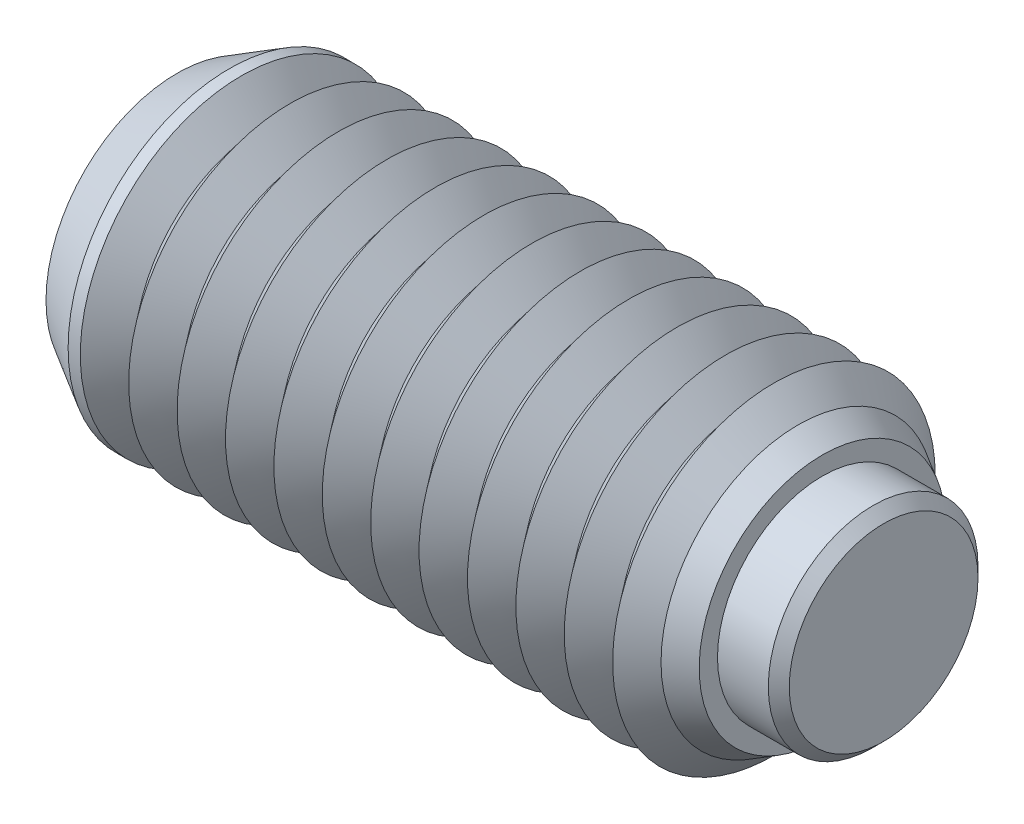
ISO-10303-21;
HEADER;
FILE_DESCRIPTION(('STEP AP214'),'2;1');
FILE_NAME('part.step','',(''),(''),'','','');
FILE_SCHEMA(('AUTOMOTIVE_DESIGN { 1 0 10303 214 1 1 1 1 }'));
ENDSEC;
DATA;
#1=APPLICATION_CONTEXT('core data for automotive mechanical design processes');
#2=APPLICATION_PROTOCOL_DEFINITION('international standard','automotive_design',2000,#1);
#3=PRODUCT_CONTEXT('',#1,'mechanical');
#4=PRODUCT('Part','Part','',(#3));
#5=PRODUCT_RELATED_PRODUCT_CATEGORY('part','',(#4));
#6=PRODUCT_DEFINITION_FORMATION('','',#4);
#7=PRODUCT_DEFINITION_CONTEXT('part definition',#1,'design');
#8=PRODUCT_DEFINITION('design','',#6,#7);
#9=PRODUCT_DEFINITION_SHAPE('','',#8);
#10=(LENGTH_UNIT() NAMED_UNIT(*) SI_UNIT(.MILLI.,.METRE.));
#11=(NAMED_UNIT(*) PLANE_ANGLE_UNIT() SI_UNIT($,.RADIAN.));
#12=(NAMED_UNIT(*) SI_UNIT($,.STERADIAN.) SOLID_ANGLE_UNIT());
#13=UNCERTAINTY_MEASURE_WITH_UNIT(LENGTH_MEASURE(1.E-05),#10,'distance_accuracy_value','');
#14=(GEOMETRIC_REPRESENTATION_CONTEXT(3) GLOBAL_UNCERTAINTY_ASSIGNED_CONTEXT((#13)) GLOBAL_UNIT_ASSIGNED_CONTEXT((#10,
#11,#12)) REPRESENTATION_CONTEXT('',''));
#15=CARTESIAN_POINT('',(0.,0.,0.));
#16=DIRECTION('',(0.,0.,1.));
#17=DIRECTION('',(1.,0.,0.));
#18=AXIS2_PLACEMENT_3D('',#15,#16,#17);
#19=CARTESIAN_POINT('',(2.65,0.,0.));
#20=DIRECTION('',(-1.,0.,0.));
#21=DIRECTION('',(0.,0.,1.));
#22=AXIS2_PLACEMENT_3D('',#19,#20,#21);
#23=CYLINDRICAL_SURFACE('',#22,3.25);
#24=CARTESIAN_POINT('',(2.325,0.,0.));
#25=DIRECTION('',(1.,0.,0.));
#26=DIRECTION('',(0.,0.,-1.));
#27=AXIS2_PLACEMENT_3D('',#24,#25,#26);
#28=CIRCLE('',#27,3.25);
#29=CARTESIAN_POINT('',(2.325,0.,3.25));
#30=VERTEX_POINT('',#29);
#31=EDGE_CURVE('P0_E10',#30,#30,#28,.F.);
#32=CARTESIAN_POINT('',(-1.15,0.,0.));
#33=DIRECTION('',(1.,0.,0.));
#34=DIRECTION('',(0.,0.,-1.));
#35=AXIS2_PLACEMENT_3D('',#32,#33,#34);
#36=CIRCLE('',#35,3.25);
#37=CARTESIAN_POINT('',(-1.15,0.,3.25));
#38=VERTEX_POINT('',#37);
#39=EDGE_CURVE('P0_E25',#38,#38,#36,.T.);
#40=CARTESIAN_POINT('',(2.325,0.,3.25));
#41=CARTESIAN_POINT('',(2.28880208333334,0.,3.25));
#42=CARTESIAN_POINT('',(2.25260416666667,0.,3.25));
#43=CARTESIAN_POINT('',(2.18020833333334,0.,3.25));
#44=CARTESIAN_POINT('',(2.14401041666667,0.,3.25));
#45=CARTESIAN_POINT('',(2.07161458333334,0.,3.25));
#46=CARTESIAN_POINT('',(2.03541666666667,0.,3.25));
#47=CARTESIAN_POINT('',(1.96302083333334,0.,3.25));
#48=CARTESIAN_POINT('',(1.92682291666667,0.,3.25));
#49=CARTESIAN_POINT('',(1.85442708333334,0.,3.25));
#50=CARTESIAN_POINT('',(1.81822916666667,0.,3.25));
#51=CARTESIAN_POINT('',(1.74583333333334,0.,3.25));
#52=CARTESIAN_POINT('',(1.70963541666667,0.,3.25));
#53=CARTESIAN_POINT('',(1.63723958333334,0.,3.25));
#54=CARTESIAN_POINT('',(1.60104166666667,0.,3.25));
#55=CARTESIAN_POINT('',(1.52864583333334,0.,3.25));
#56=CARTESIAN_POINT('',(1.49244791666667,0.,3.25));
#57=CARTESIAN_POINT('',(1.42005208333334,0.,3.25));
#58=CARTESIAN_POINT('',(1.38385416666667,0.,3.25));
#59=CARTESIAN_POINT('',(1.31145833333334,0.,3.25));
#60=CARTESIAN_POINT('',(1.27526041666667,0.,3.25));
#61=CARTESIAN_POINT('',(1.20286458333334,0.,3.25));
#62=CARTESIAN_POINT('',(1.16666666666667,0.,3.25));
#63=CARTESIAN_POINT('',(1.09427083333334,0.,3.25));
#64=CARTESIAN_POINT('',(1.05807291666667,0.,3.25));
#65=CARTESIAN_POINT('',(0.985677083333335,0.,3.25));
#66=CARTESIAN_POINT('',(0.949479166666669,0.,3.25));
#67=CARTESIAN_POINT('',(0.877083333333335,0.,3.25));
#68=CARTESIAN_POINT('',(0.840885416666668,0.,3.25));
#69=CARTESIAN_POINT('',(0.768489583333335,0.,3.25));
#70=CARTESIAN_POINT('',(0.732291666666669,0.,3.25));
#71=CARTESIAN_POINT('',(0.659895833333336,0.,3.25));
#72=CARTESIAN_POINT('',(0.623697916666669,0.,3.25));
#73=CARTESIAN_POINT('',(0.551302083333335,0.,3.25));
#74=CARTESIAN_POINT('',(0.515104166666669,0.,3.25));
#75=CARTESIAN_POINT('',(0.442708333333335,0.,3.25));
#76=CARTESIAN_POINT('',(0.406510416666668,0.,3.25));
#77=CARTESIAN_POINT('',(0.334114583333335,0.,3.25));
#78=CARTESIAN_POINT('',(0.297916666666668,0.,3.25));
#79=CARTESIAN_POINT('',(0.225520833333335,0.,3.25));
#80=CARTESIAN_POINT('',(0.189322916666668,0.,3.25));
#81=CARTESIAN_POINT('',(0.116927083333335,0.,3.25));
#82=CARTESIAN_POINT('',(0.0807291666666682,0.,3.25));
#83=CARTESIAN_POINT('',(0.00833333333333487,0.,3.25));
#84=CARTESIAN_POINT('',(-0.0278645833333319,0.,3.25));
#85=CARTESIAN_POINT('',(-0.100260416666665,0.,3.25));
#86=CARTESIAN_POINT('',(-0.136458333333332,0.,3.25));
#87=CARTESIAN_POINT('',(-0.208854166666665,0.,3.25));
#88=CARTESIAN_POINT('',(-0.245052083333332,0.,3.25));
#89=CARTESIAN_POINT('',(-0.317447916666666,0.,3.25));
#90=CARTESIAN_POINT('',(-0.353645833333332,0.,3.25));
#91=CARTESIAN_POINT('',(-0.426041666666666,0.,3.25));
#92=CARTESIAN_POINT('',(-0.462239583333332,0.,3.25));
#93=CARTESIAN_POINT('',(-0.534635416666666,0.,3.25));
#94=CARTESIAN_POINT('',(-0.570833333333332,0.,3.25));
#95=CARTESIAN_POINT('',(-0.643229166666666,0.,3.25));
#96=CARTESIAN_POINT('',(-0.679427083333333,0.,3.25));
#97=CARTESIAN_POINT('',(-0.751822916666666,0.,3.25));
#98=CARTESIAN_POINT('',(-0.788020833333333,0.,3.25));
#99=CARTESIAN_POINT('',(-0.860416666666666,0.,3.25));
#100=CARTESIAN_POINT('',(-0.896614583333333,0.,3.25));
#101=CARTESIAN_POINT('',(-0.969010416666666,0.,3.25));
#102=CARTESIAN_POINT('',(-1.00520833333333,0.,3.25));
#103=CARTESIAN_POINT('',(-1.07760416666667,0.,3.25));
#104=CARTESIAN_POINT('',(-1.11380208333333,0.,3.25));
#105=CARTESIAN_POINT('',(-1.15,0.,3.25));
#106=B_SPLINE_CURVE_WITH_KNOTS('',3,(#40,#41,#42,#43,#44,#45,#46,#47,#48,#49,#50,#51,#52,#53,
#54,#55,#56,#57,#58,#59,#60,#61,#62,#63,#64,#65,#66,#67,#68,#69,#70,#71,#72,#73,#74,#75,#76,#77,
#78,#79,#80,#81,#82,#83,#84,#85,#86,#87,#88,#89,#90,#91,#92,#93,#94,#95,#96,#97,#98,#99,#100,
#101,#102,#103,#104,#105),.UNSPECIFIED.,.F.,.F.,(4,2,2,2,2,2,2,2,2,2,2,2,2,2,2,2,2,2,2,2,2,2,2,
2,2,2,2,2,2,2,2,2,4),(0.,0.10859375,0.2171875,0.32578125,0.434375,0.54296875,0.6515625,
0.76015625,0.86875,0.977343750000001,1.0859375,1.19453125,1.303125,1.41171875,1.5203125,
1.62890625,1.7375,1.84609375,1.9546875,2.06328125,2.171875,2.28046875,2.3890625,2.49765625,
2.60625,2.71484375,2.8234375,2.93203125,3.040625,3.14921875,3.2578125,3.36640625,3.475),.UNSPECIFIED.);
#107=EDGE_CURVE('P0_BSEAM14',#30,#38,#106,.T.);
#108=ORIENTED_EDGE('',*,*,#31,.T.);
#109=ORIENTED_EDGE('',*,*,#39,.T.);
#110=ORIENTED_EDGE('',*,*,#107,.T.);
#111=ORIENTED_EDGE('',*,*,#107,.F.);
#112=EDGE_LOOP('',(#108,#110,#109,#111));
#113=FACE_BOUND('',#112,.T.);
#114=ADVANCED_FACE('P0_F14',(#113),#23,.T.);
#115=CARTESIAN_POINT('',(2.65,0.,0.));
#116=DIRECTION('',(1.,0.,0.));
#117=DIRECTION('',(0.,0.,-1.));
#118=AXIS2_PLACEMENT_3D('',#115,#116,#117);
#119=PLANE('',#118);
#120=CARTESIAN_POINT('',(2.65,0.,0.));
#121=DIRECTION('',(1.,0.,0.));
#122=DIRECTION('',(0.,0.,-1.));
#123=AXIS2_PLACEMENT_3D('',#120,#121,#122);
#124=CIRCLE('',#123,2.92500000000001);
#125=CARTESIAN_POINT('',(2.65,0.,-2.92500000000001));
#126=VERTEX_POINT('',#125);
#127=EDGE_CURVE('P0_E21',#126,#126,#124,.T.);
#128=ORIENTED_EDGE('',*,*,#127,.T.);
#129=EDGE_LOOP('',(#128));
#130=FACE_BOUND('',#129,.T.);
#131=ADVANCED_FACE('P0_F35',(#130),#119,.T.);
#132=CARTESIAN_POINT('',(-1.15,0.,0.));
#133=DIRECTION('',(1.,0.,0.));
#134=DIRECTION('',(0.,0.,-1.));
#135=AXIS2_PLACEMENT_3D('',#132,#133,#134);
#136=PLANE('',#135);
#137=ORIENTED_EDGE('',*,*,#39,.F.);
#138=EDGE_LOOP('',(#137));
#139=FACE_BOUND('',#138,.T.);
#140=ADVANCED_FACE('P0_F33',(#139),#136,.F.);
#141=CARTESIAN_POINT('',(2.65,0.,0.));
#142=DIRECTION('',(-1.,0.,0.));
#143=DIRECTION('',(0.,0.,1.));
#144=AXIS2_PLACEMENT_3D('',#141,#142,#143);
#145=CONICAL_SURFACE('',#144,2.92500000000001,0.785398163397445);
#146=ORIENTED_EDGE('',*,*,#31,.F.);
#147=EDGE_LOOP('',(#146));
#148=FACE_BOUND('',#147,.T.);
#149=ORIENTED_EDGE('',*,*,#127,.F.);
#150=EDGE_LOOP('',(#149));
#151=FACE_BOUND('',#150,.T.);
#152=ADVANCED_FACE('P0_F16',(#148,#151),#145,.T.);
#153=CLOSED_SHELL('',(#114,#131,#140,#152));
#154=MANIFOLD_SOLID_BREP('P0_B1',#153);
#155=CARTESIAN_POINT('',(-19.25,0.,0.));
#156=DIRECTION('',(1.,0.,0.));
#157=DIRECTION('',(0.,0.,-1.));
#158=AXIS2_PLACEMENT_3D('',#155,#156,#157);
#159=CYLINDRICAL_SURFACE('',#158,5.);
#160=CARTESIAN_POINT('',(-17.25,0.,0.));
#161=DIRECTION('',(1.,0.,0.));
#162=DIRECTION('',(0.,0.,-1.));
#163=AXIS2_PLACEMENT_3D('',#160,#161,#162);
#164=CIRCLE('',#163,5.);
#165=CARTESIAN_POINT('',(-17.25,0.,-5.));
#166=VERTEX_POINT('',#165);
#167=EDGE_CURVE('P1_E226',#166,#166,#164,.T.);
#168=ORIENTED_EDGE('',*,*,#167,.F.);
#169=EDGE_LOOP('',(#168));
#170=FACE_BOUND('',#169,.T.);
#171=CARTESIAN_POINT('',(-17.6275019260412,0.,0.));
#172=DIRECTION('',(1.,0.,0.));
#173=DIRECTION('',(0.,0.,-1.));
#174=AXIS2_PLACEMENT_3D('',#171,#172,#173);
#175=CIRCLE('',#174,5.);
#176=CARTESIAN_POINT('',(-17.6275019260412,0.,-5.));
#177=VERTEX_POINT('',#176);
#178=EDGE_CURVE('P1_E229',#177,#177,#175,.T.);
#179=ORIENTED_EDGE('',*,*,#178,.T.);
#180=EDGE_LOOP('',(#179));
#181=FACE_BOUND('',#180,.T.);
#182=ADVANCED_FACE('P1_F15',(#170,#181),#159,.T.);
#183=CARTESIAN_POINT('',(-1.5,0.,0.));
#184=DIRECTION('',(1.,0.,0.));
#185=DIRECTION('',(0.,0.,-1.));
#186=AXIS2_PLACEMENT_3D('',#183,#184,#185);
#187=CONICAL_SURFACE('',#186,4.06325030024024,0.895664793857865);
#188=CARTESIAN_POINT('',(-0.750000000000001,0.,0.));
#189=DIRECTION('',(1.,0.,0.));
#190=DIRECTION('',(0.,0.,-1.));
#191=AXIS2_PLACEMENT_3D('',#188,#189,#190);
#192=CIRCLE('',#191,5.);
#193=CARTESIAN_POINT('',(-0.750000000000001,0.,-5.));
#194=VERTEX_POINT('',#193);
#195=EDGE_CURVE('P1_E284',#194,#194,#192,.T.);
#196=ORIENTED_EDGE('',*,*,#195,.F.);
#197=EDGE_LOOP('',(#196));
#198=FACE_BOUND('',#197,.T.);
#199=CARTESIAN_POINT('',(-1.5,0.,0.));
#200=DIRECTION('',(1.,0.,0.));
#201=DIRECTION('',(0.,0.,-1.));
#202=AXIS2_PLACEMENT_3D('',#199,#200,#201);
#203=CIRCLE('',#202,4.06325030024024);
#204=CARTESIAN_POINT('',(-1.5,0.,-4.06325030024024));
#205=VERTEX_POINT('',#204);
#206=EDGE_CURVE('P1_E289',#205,#205,#203,.T.);
#207=ORIENTED_EDGE('',*,*,#206,.T.);
#208=EDGE_LOOP('',(#207));
#209=FACE_BOUND('',#208,.T.);
#210=ADVANCED_FACE('P1_F214',(#198,#209),#187,.T.);
#211=CARTESIAN_POINT('',(-2.25,0.,0.));
#212=DIRECTION('',(-1.,0.,0.));
#213=DIRECTION('',(0.,0.,1.));
#214=AXIS2_PLACEMENT_3D('',#211,#212,#213);
#215=CONICAL_SURFACE('',#214,5.,0.895664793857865);
#216=ORIENTED_EDGE('',*,*,#206,.F.);
#217=EDGE_LOOP('',(#216));
#218=FACE_BOUND('',#217,.T.);
#219=CARTESIAN_POINT('',(-2.25,0.,0.));
#220=DIRECTION('',(1.,0.,0.));
#221=DIRECTION('',(0.,0.,-1.));
#222=AXIS2_PLACEMENT_3D('',#219,#220,#221);
#223=CIRCLE('',#222,5.);
#224=CARTESIAN_POINT('',(-2.25,0.,-5.));
#225=VERTEX_POINT('',#224);
#226=EDGE_CURVE('P1_E292',#225,#225,#223,.T.);
#227=ORIENTED_EDGE('',*,*,#226,.T.);
#228=EDGE_LOOP('',(#227));
#229=FACE_BOUND('',#228,.T.);
#230=ADVANCED_FACE('P1_F220',(#218,#229),#215,.T.);
#231=CARTESIAN_POINT('',(-1.15,0.,0.));
#232=DIRECTION('',(1.,0.,0.));
#233=DIRECTION('',(0.,1.,0.));
#234=AXIS2_PLACEMENT_3D('',#231,#232,#233);
#235=PLANE('',#234);
#236=CARTESIAN_POINT('',(-1.15,0.,0.));
#237=DIRECTION('',(1.,0.,0.));
#238=DIRECTION('',(0.,1.,0.));
#239=AXIS2_PLACEMENT_3D('',#236,#237,#238);
#240=CIRCLE('',#239,3.25);
#241=CARTESIAN_POINT('',(-1.15,3.25,0.));
#242=VERTEX_POINT('',#241);
#243=EDGE_CURVE('P1_E279',#242,#242,#240,.T.);
#244=ORIENTED_EDGE('',*,*,#243,.T.);
#245=EDGE_LOOP('',(#244));
#246=FACE_BOUND('',#245,.T.);
#247=ADVANCED_FACE('P1_F437',(#246),#235,.T.);
#248=CARTESIAN_POINT('',(-1.15,0.,0.));
#249=DIRECTION('',(1.,0.,0.));
#250=DIRECTION('',(0.,1.,0.));
#251=AXIS2_PLACEMENT_3D('',#248,#249,#250);
#252=CYLINDRICAL_SURFACE('',#251,3.25);
#253=CARTESIAN_POINT('',(0.75,0.,0.));
#254=DIRECTION('',(1.,0.,0.));
#255=DIRECTION('',(0.,1.,0.));
#256=AXIS2_PLACEMENT_3D('',#253,#254,#255);
#257=CIRCLE('',#256,3.25);
#258=CARTESIAN_POINT('',(0.75,3.25,0.));
#259=VERTEX_POINT('',#258);
#260=EDGE_CURVE('P1_E281',#259,#259,#257,.T.);
#261=CARTESIAN_POINT('',(-1.15,3.25,0.));
#262=CARTESIAN_POINT('',(-1.13020833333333,3.25,0.));
#263=CARTESIAN_POINT('',(-1.11041666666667,3.25,0.));
#264=CARTESIAN_POINT('',(-1.07083333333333,3.25,0.));
#265=CARTESIAN_POINT('',(-1.05104166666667,3.25,0.));
#266=CARTESIAN_POINT('',(-1.01145833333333,3.25,0.));
#267=CARTESIAN_POINT('',(-0.991666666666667,3.25,0.));
#268=CARTESIAN_POINT('',(-0.952083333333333,3.25,0.));
#269=CARTESIAN_POINT('',(-0.932291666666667,3.25,0.));
#270=CARTESIAN_POINT('',(-0.892708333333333,3.25,0.));
#271=CARTESIAN_POINT('',(-0.872916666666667,3.25,0.));
#272=CARTESIAN_POINT('',(-0.833333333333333,3.25,0.));
#273=CARTESIAN_POINT('',(-0.813541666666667,3.25,0.));
#274=CARTESIAN_POINT('',(-0.773958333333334,3.25,0.));
#275=CARTESIAN_POINT('',(-0.754166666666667,3.25,0.));
#276=CARTESIAN_POINT('',(-0.714583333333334,3.25,0.));
#277=CARTESIAN_POINT('',(-0.694791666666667,3.25,0.));
#278=CARTESIAN_POINT('',(-0.655208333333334,3.25,0.));
#279=CARTESIAN_POINT('',(-0.635416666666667,3.25,0.));
#280=CARTESIAN_POINT('',(-0.595833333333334,3.25,0.));
#281=CARTESIAN_POINT('',(-0.576041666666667,3.25,0.));
#282=CARTESIAN_POINT('',(-0.536458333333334,3.25,0.));
#283=CARTESIAN_POINT('',(-0.516666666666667,3.25,0.));
#284=CARTESIAN_POINT('',(-0.477083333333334,3.25,0.));
#285=CARTESIAN_POINT('',(-0.457291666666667,3.25,0.));
#286=CARTESIAN_POINT('',(-0.417708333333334,3.25,0.));
#287=CARTESIAN_POINT('',(-0.397916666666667,3.25,0.));
#288=CARTESIAN_POINT('',(-0.358333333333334,3.25,0.));
#289=CARTESIAN_POINT('',(-0.338541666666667,3.25,0.));
#290=CARTESIAN_POINT('',(-0.298958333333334,3.25,0.));
#291=CARTESIAN_POINT('',(-0.279166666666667,3.25,0.));
#292=CARTESIAN_POINT('',(-0.239583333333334,3.25,0.));
#293=CARTESIAN_POINT('',(-0.219791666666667,3.25,0.));
#294=CARTESIAN_POINT('',(-0.180208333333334,3.25,0.));
#295=CARTESIAN_POINT('',(-0.160416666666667,3.25,0.));
#296=CARTESIAN_POINT('',(-0.120833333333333,3.25,0.));
#297=CARTESIAN_POINT('',(-0.101041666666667,3.25,0.));
#298=CARTESIAN_POINT('',(-0.0614583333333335,3.25,0.));
#299=CARTESIAN_POINT('',(-0.0416666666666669,3.25,0.));
#300=CARTESIAN_POINT('',(-0.00208333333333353,3.25,0.));
#301=CARTESIAN_POINT('',(0.0177083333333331,3.25,0.));
#302=CARTESIAN_POINT('',(0.0572916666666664,3.25,0.));
#303=CARTESIAN_POINT('',(0.0770833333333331,3.25,0.));
#304=CARTESIAN_POINT('',(0.116666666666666,3.25,0.));
#305=CARTESIAN_POINT('',(0.136458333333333,3.25,0.));
#306=CARTESIAN_POINT('',(0.176041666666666,3.25,0.));
#307=CARTESIAN_POINT('',(0.195833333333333,3.25,0.));
#308=CARTESIAN_POINT('',(0.235416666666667,3.25,0.));
#309=CARTESIAN_POINT('',(0.255208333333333,3.25,0.));
#310=CARTESIAN_POINT('',(0.294791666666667,3.25,0.));
#311=CARTESIAN_POINT('',(0.314583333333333,3.25,0.));
#312=CARTESIAN_POINT('',(0.354166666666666,3.25,0.));
#313=CARTESIAN_POINT('',(0.373958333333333,3.25,0.));
#314=CARTESIAN_POINT('',(0.413541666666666,3.25,0.));
#315=CARTESIAN_POINT('',(0.433333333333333,3.25,0.));
#316=CARTESIAN_POINT('',(0.472916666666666,3.25,0.));
#317=CARTESIAN_POINT('',(0.492708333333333,3.25,0.));
#318=CARTESIAN_POINT('',(0.532291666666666,3.25,0.));
#319=CARTESIAN_POINT('',(0.552083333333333,3.25,0.));
#320=CARTESIAN_POINT('',(0.591666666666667,3.25,0.));
#321=CARTESIAN_POINT('',(0.611458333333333,3.25,0.));
#322=CARTESIAN_POINT('',(0.651041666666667,3.25,0.));
#323=CARTESIAN_POINT('',(0.670833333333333,3.25,0.));
#324=CARTESIAN_POINT('',(0.710416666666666,3.25,0.));
#325=CARTESIAN_POINT('',(0.730208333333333,3.25,0.));
#326=CARTESIAN_POINT('',(0.75,3.25,0.));
#327=B_SPLINE_CURVE_WITH_KNOTS('',3,(#261,#262,#263,#264,#265,#266,#267,#268,#269,#270,#271,
#272,#273,#274,#275,#276,#277,#278,#279,#280,#281,#282,#283,#284,#285,#286,#287,#288,#289,#290,
#291,#292,#293,#294,#295,#296,#297,#298,#299,#300,#301,#302,#303,#304,#305,#306,#307,#308,#309,
#310,#311,#312,#313,#314,#315,#316,#317,#318,#319,#320,#321,#322,#323,#324,#325,#326),
.UNSPECIFIED.,.F.,.F.,(4,2,2,2,2,2,2,2,2,2,2,2,2,2,2,2,2,2,2,2,2,2,2,2,2,2,2,2,2,2,2,2,4),(0.,
0.059375,0.11875,0.178125,0.2375,0.296875,0.35625,0.415625,0.475,0.534375,0.59375,0.653125,
0.7125,0.771875,0.83125,0.890625,0.95,1.009375,1.06875,1.128125,1.1875,1.246875,1.30625,
1.365625,1.425,1.484375,1.54375,1.603125,1.6625,1.721875,1.78125,1.840625,1.9),.UNSPECIFIED.);
#328=EDGE_CURVE('P1_BSEAM210',#242,#259,#327,.T.);
#329=ORIENTED_EDGE('',*,*,#243,.F.);
#330=ORIENTED_EDGE('',*,*,#260,.T.);
#331=ORIENTED_EDGE('',*,*,#328,.T.);
#332=ORIENTED_EDGE('',*,*,#328,.F.);
#333=EDGE_LOOP('',(#329,#331,#330,#332));
#334=FACE_BOUND('',#333,.T.);
#335=ADVANCED_FACE('P1_F210',(#334),#252,.F.);
#336=CARTESIAN_POINT('',(0.75,3.81698729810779,0.));
#337=DIRECTION('',(1.,0.,0.));
#338=DIRECTION('',(0.,1.,0.));
#339=AXIS2_PLACEMENT_3D('',#336,#337,#338);
#340=PLANE('',#339);
#341=ORIENTED_EDGE('',*,*,#260,.F.);
#342=EDGE_LOOP('',(#341));
#343=FACE_BOUND('',#342,.T.);
#344=CARTESIAN_POINT('',(0.75,0.,0.));
#345=DIRECTION('',(1.,0.,0.));
#346=DIRECTION('',(0.,1.,0.));
#347=AXIS2_PLACEMENT_3D('',#344,#345,#346);
#348=CIRCLE('',#347,3.81698729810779);
#349=CARTESIAN_POINT('',(0.75,3.81698729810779,0.));
#350=VERTEX_POINT('',#349);
#351=EDGE_CURVE('P1_E121',#350,#350,#348,.T.);
#352=ORIENTED_EDGE('',*,*,#351,.T.);
#353=EDGE_LOOP('',(#352));
#354=FACE_BOUND('',#353,.T.);
#355=ADVANCED_FACE('P1_F206',(#343,#354),#340,.T.);
#356=CARTESIAN_POINT('',(0.75,0.,0.));
#357=DIRECTION('',(-1.,0.,0.));
#358=DIRECTION('',(0.,-1.,0.));
#359=AXIS2_PLACEMENT_3D('',#356,#357,#358);
#360=CONICAL_SURFACE('',#359,3.81698729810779,0.523598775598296);
#361=CARTESIAN_POINT('',(0.,0.,0.));
#362=DIRECTION('',(1.,0.,0.));
#363=DIRECTION('',(0.,0.,-1.));
#364=AXIS2_PLACEMENT_3D('',#361,#362,#363);
#365=CIRCLE('',#364,4.25000000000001);
#366=CARTESIAN_POINT('',(0.,0.,-4.25000000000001));
#367=VERTEX_POINT('',#366);
#368=EDGE_CURVE('P1_E236',#367,#367,#365,.T.);
#369=ORIENTED_EDGE('',*,*,#368,.T.);
#370=EDGE_LOOP('',(#369));
#371=FACE_BOUND('',#370,.T.);
#372=ORIENTED_EDGE('',*,*,#351,.F.);
#373=EDGE_LOOP('',(#372));
#374=FACE_BOUND('',#373,.T.);
#375=ADVANCED_FACE('P1_F203',(#371,#374),#360,.T.);
#376=CARTESIAN_POINT('',(0.,0.,0.));
#377=DIRECTION('',(-1.,0.,0.));
#378=DIRECTION('',(0.,0.,1.));
#379=AXIS2_PLACEMENT_3D('',#376,#377,#378);
#380=CONICAL_SURFACE('',#379,4.25000000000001,0.785398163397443);
#381=ORIENTED_EDGE('',*,*,#195,.T.);
#382=EDGE_LOOP('',(#381));
#383=FACE_BOUND('',#382,.T.);
#384=ORIENTED_EDGE('',*,*,#368,.F.);
#385=EDGE_LOOP('',(#384));
#386=FACE_BOUND('',#385,.T.);
#387=ADVANCED_FACE('P1_F17',(#383,#386),#380,.T.);
#388=CARTESIAN_POINT('',(-3.,0.,0.));
#389=DIRECTION('',(1.,0.,0.));
#390=DIRECTION('',(0.,0.,-1.));
#391=AXIS2_PLACEMENT_3D('',#388,#389,#390);
#392=CONICAL_SURFACE('',#391,4.06325030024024,0.895664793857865);
#393=ORIENTED_EDGE('',*,*,#226,.F.);
#394=EDGE_LOOP('',(#393));
#395=FACE_BOUND('',#394,.T.);
#396=CARTESIAN_POINT('',(-3.,0.,0.));
#397=DIRECTION('',(1.,0.,0.));
#398=DIRECTION('',(0.,0.,-1.));
#399=AXIS2_PLACEMENT_3D('',#396,#397,#398);
#400=CIRCLE('',#399,4.06325030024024);
#401=CARTESIAN_POINT('',(-3.,0.,-4.06325030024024));
#402=VERTEX_POINT('',#401);
#403=EDGE_CURVE('P1_E295',#402,#402,#400,.T.);
#404=ORIENTED_EDGE('',*,*,#403,.T.);
#405=EDGE_LOOP('',(#404));
#406=FACE_BOUND('',#405,.T.);
#407=ADVANCED_FACE('P1_F431',(#395,#406),#392,.T.);
#408=CARTESIAN_POINT('',(-3.75,0.,0.));
#409=DIRECTION('',(-1.,0.,0.));
#410=DIRECTION('',(0.,0.,1.));
#411=AXIS2_PLACEMENT_3D('',#408,#409,#410);
#412=CONICAL_SURFACE('',#411,5.,0.895664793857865);
#413=ORIENTED_EDGE('',*,*,#403,.F.);
#414=EDGE_LOOP('',(#413));
#415=FACE_BOUND('',#414,.T.);
#416=CARTESIAN_POINT('',(-3.75,0.,0.));
#417=DIRECTION('',(1.,0.,0.));
#418=DIRECTION('',(0.,0.,-1.));
#419=AXIS2_PLACEMENT_3D('',#416,#417,#418);
#420=CIRCLE('',#419,5.);
#421=CARTESIAN_POINT('',(-3.75,0.,-5.));
#422=VERTEX_POINT('',#421);
#423=EDGE_CURVE('P1_E298',#422,#422,#420,.T.);
#424=ORIENTED_EDGE('',*,*,#423,.T.);
#425=EDGE_LOOP('',(#424));
#426=FACE_BOUND('',#425,.T.);
#427=ADVANCED_FACE('P1_F427',(#415,#426),#412,.T.);
#428=CARTESIAN_POINT('',(-4.5,0.,0.));
#429=DIRECTION('',(1.,0.,0.));
#430=DIRECTION('',(0.,0.,-1.));
#431=AXIS2_PLACEMENT_3D('',#428,#429,#430);
#432=CONICAL_SURFACE('',#431,4.06325030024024,0.895664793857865);
#433=ORIENTED_EDGE('',*,*,#423,.F.);
#434=EDGE_LOOP('',(#433));
#435=FACE_BOUND('',#434,.T.);
#436=CARTESIAN_POINT('',(-4.5,0.,0.));
#437=DIRECTION('',(1.,0.,0.));
#438=DIRECTION('',(0.,0.,-1.));
#439=AXIS2_PLACEMENT_3D('',#436,#437,#438);
#440=CIRCLE('',#439,4.06325030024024);
#441=CARTESIAN_POINT('',(-4.5,0.,-4.06325030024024));
#442=VERTEX_POINT('',#441);
#443=EDGE_CURVE('P1_E301',#442,#442,#440,.T.);
#444=ORIENTED_EDGE('',*,*,#443,.T.);
#445=EDGE_LOOP('',(#444));
#446=FACE_BOUND('',#445,.T.);
#447=ADVANCED_FACE('P1_F423',(#435,#446),#432,.T.);
#448=CARTESIAN_POINT('',(-5.25,0.,0.));
#449=DIRECTION('',(-1.,0.,0.));
#450=DIRECTION('',(0.,0.,1.));
#451=AXIS2_PLACEMENT_3D('',#448,#449,#450);
#452=CONICAL_SURFACE('',#451,5.,0.895664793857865);
#453=ORIENTED_EDGE('',*,*,#443,.F.);
#454=EDGE_LOOP('',(#453));
#455=FACE_BOUND('',#454,.T.);
#456=CARTESIAN_POINT('',(-5.25,0.,0.));
#457=DIRECTION('',(1.,0.,0.));
#458=DIRECTION('',(0.,0.,-1.));
#459=AXIS2_PLACEMENT_3D('',#456,#457,#458);
#460=CIRCLE('',#459,5.);
#461=CARTESIAN_POINT('',(-5.25,0.,-5.));
#462=VERTEX_POINT('',#461);
#463=EDGE_CURVE('P1_E304',#462,#462,#460,.T.);
#464=ORIENTED_EDGE('',*,*,#463,.T.);
#465=EDGE_LOOP('',(#464));
#466=FACE_BOUND('',#465,.T.);
#467=ADVANCED_FACE('P1_F419',(#455,#466),#452,.T.);
#468=CARTESIAN_POINT('',(-6.,0.,0.));
#469=DIRECTION('',(1.,0.,0.));
#470=DIRECTION('',(0.,0.,-1.));
#471=AXIS2_PLACEMENT_3D('',#468,#469,#470);
#472=CONICAL_SURFACE('',#471,4.06325030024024,0.895664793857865);
#473=ORIENTED_EDGE('',*,*,#463,.F.);
#474=EDGE_LOOP('',(#473));
#475=FACE_BOUND('',#474,.T.);
#476=CARTESIAN_POINT('',(-6.,0.,0.));
#477=DIRECTION('',(1.,0.,0.));
#478=DIRECTION('',(0.,0.,-1.));
#479=AXIS2_PLACEMENT_3D('',#476,#477,#478);
#480=CIRCLE('',#479,4.06325030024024);
#481=CARTESIAN_POINT('',(-6.,0.,-4.06325030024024));
#482=VERTEX_POINT('',#481);
#483=EDGE_CURVE('P1_E307',#482,#482,#480,.T.);
#484=ORIENTED_EDGE('',*,*,#483,.T.);
#485=EDGE_LOOP('',(#484));
#486=FACE_BOUND('',#485,.T.);
#487=ADVANCED_FACE('P1_F415',(#475,#486),#472,.T.);
#488=CARTESIAN_POINT('',(-6.75,0.,0.));
#489=DIRECTION('',(-1.,0.,0.));
#490=DIRECTION('',(0.,0.,1.));
#491=AXIS2_PLACEMENT_3D('',#488,#489,#490);
#492=CONICAL_SURFACE('',#491,5.,0.895664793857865);
#493=ORIENTED_EDGE('',*,*,#483,.F.);
#494=EDGE_LOOP('',(#493));
#495=FACE_BOUND('',#494,.T.);
#496=CARTESIAN_POINT('',(-6.75,0.,0.));
#497=DIRECTION('',(1.,0.,0.));
#498=DIRECTION('',(0.,0.,-1.));
#499=AXIS2_PLACEMENT_3D('',#496,#497,#498);
#500=CIRCLE('',#499,5.);
#501=CARTESIAN_POINT('',(-6.75,0.,-5.));
#502=VERTEX_POINT('',#501);
#503=EDGE_CURVE('P1_E310',#502,#502,#500,.T.);
#504=ORIENTED_EDGE('',*,*,#503,.T.);
#505=EDGE_LOOP('',(#504));
#506=FACE_BOUND('',#505,.T.);
#507=ADVANCED_FACE('P1_F411',(#495,#506),#492,.T.);
#508=CARTESIAN_POINT('',(-7.5,0.,0.));
#509=DIRECTION('',(1.,0.,0.));
#510=DIRECTION('',(0.,0.,-1.));
#511=AXIS2_PLACEMENT_3D('',#508,#509,#510);
#512=CONICAL_SURFACE('',#511,4.06325030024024,0.895664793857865);
#513=ORIENTED_EDGE('',*,*,#503,.F.);
#514=EDGE_LOOP('',(#513));
#515=FACE_BOUND('',#514,.T.);
#516=CARTESIAN_POINT('',(-7.5,0.,0.));
#517=DIRECTION('',(1.,0.,0.));
#518=DIRECTION('',(0.,0.,-1.));
#519=AXIS2_PLACEMENT_3D('',#516,#517,#518);
#520=CIRCLE('',#519,4.06325030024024);
#521=CARTESIAN_POINT('',(-7.5,0.,-4.06325030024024));
#522=VERTEX_POINT('',#521);
#523=EDGE_CURVE('P1_E313',#522,#522,#520,.T.);
#524=ORIENTED_EDGE('',*,*,#523,.T.);
#525=EDGE_LOOP('',(#524));
#526=FACE_BOUND('',#525,.T.);
#527=ADVANCED_FACE('P1_F407',(#515,#526),#512,.T.);
#528=CARTESIAN_POINT('',(-8.25,0.,0.));
#529=DIRECTION('',(-1.,0.,0.));
#530=DIRECTION('',(0.,0.,1.));
#531=AXIS2_PLACEMENT_3D('',#528,#529,#530);
#532=CONICAL_SURFACE('',#531,5.,0.895664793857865);
#533=ORIENTED_EDGE('',*,*,#523,.F.);
#534=EDGE_LOOP('',(#533));
#535=FACE_BOUND('',#534,.T.);
#536=CARTESIAN_POINT('',(-8.25,0.,0.));
#537=DIRECTION('',(1.,0.,0.));
#538=DIRECTION('',(0.,0.,-1.));
#539=AXIS2_PLACEMENT_3D('',#536,#537,#538);
#540=CIRCLE('',#539,5.);
#541=CARTESIAN_POINT('',(-8.25,0.,-5.));
#542=VERTEX_POINT('',#541);
#543=EDGE_CURVE('P1_E316',#542,#542,#540,.T.);
#544=ORIENTED_EDGE('',*,*,#543,.T.);
#545=EDGE_LOOP('',(#544));
#546=FACE_BOUND('',#545,.T.);
#547=ADVANCED_FACE('P1_F403',(#535,#546),#532,.T.);
#548=CARTESIAN_POINT('',(-9.,0.,0.));
#549=DIRECTION('',(1.,0.,0.));
#550=DIRECTION('',(0.,0.,-1.));
#551=AXIS2_PLACEMENT_3D('',#548,#549,#550);
#552=CONICAL_SURFACE('',#551,4.06325030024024,0.895664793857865);
#553=ORIENTED_EDGE('',*,*,#543,.F.);
#554=EDGE_LOOP('',(#553));
#555=FACE_BOUND('',#554,.T.);
#556=CARTESIAN_POINT('',(-9.,0.,0.));
#557=DIRECTION('',(1.,0.,0.));
#558=DIRECTION('',(0.,0.,-1.));
#559=AXIS2_PLACEMENT_3D('',#556,#557,#558);
#560=CIRCLE('',#559,4.06325030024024);
#561=CARTESIAN_POINT('',(-9.,0.,-4.06325030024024));
#562=VERTEX_POINT('',#561);
#563=EDGE_CURVE('P1_E319',#562,#562,#560,.T.);
#564=ORIENTED_EDGE('',*,*,#563,.T.);
#565=EDGE_LOOP('',(#564));
#566=FACE_BOUND('',#565,.T.);
#567=ADVANCED_FACE('P1_F399',(#555,#566),#552,.T.);
#568=CARTESIAN_POINT('',(-9.75,0.,0.));
#569=DIRECTION('',(-1.,0.,0.));
#570=DIRECTION('',(0.,0.,1.));
#571=AXIS2_PLACEMENT_3D('',#568,#569,#570);
#572=CONICAL_SURFACE('',#571,5.,0.895664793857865);
#573=ORIENTED_EDGE('',*,*,#563,.F.);
#574=EDGE_LOOP('',(#573));
#575=FACE_BOUND('',#574,.T.);
#576=CARTESIAN_POINT('',(-9.75,0.,0.));
#577=DIRECTION('',(1.,0.,0.));
#578=DIRECTION('',(0.,0.,-1.));
#579=AXIS2_PLACEMENT_3D('',#576,#577,#578);
#580=CIRCLE('',#579,5.);
#581=CARTESIAN_POINT('',(-9.75,0.,-5.));
#582=VERTEX_POINT('',#581);
#583=EDGE_CURVE('P1_E322',#582,#582,#580,.T.);
#584=ORIENTED_EDGE('',*,*,#583,.T.);
#585=EDGE_LOOP('',(#584));
#586=FACE_BOUND('',#585,.T.);
#587=ADVANCED_FACE('P1_F395',(#575,#586),#572,.T.);
#588=CARTESIAN_POINT('',(-10.5,0.,0.));
#589=DIRECTION('',(1.,0.,0.));
#590=DIRECTION('',(0.,0.,-1.));
#591=AXIS2_PLACEMENT_3D('',#588,#589,#590);
#592=CONICAL_SURFACE('',#591,4.06325030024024,0.895664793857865);
#593=ORIENTED_EDGE('',*,*,#583,.F.);
#594=EDGE_LOOP('',(#593));
#595=FACE_BOUND('',#594,.T.);
#596=CARTESIAN_POINT('',(-10.5,0.,0.));
#597=DIRECTION('',(1.,0.,0.));
#598=DIRECTION('',(0.,0.,-1.));
#599=AXIS2_PLACEMENT_3D('',#596,#597,#598);
#600=CIRCLE('',#599,4.06325030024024);
#601=CARTESIAN_POINT('',(-10.5,0.,-4.06325030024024));
#602=VERTEX_POINT('',#601);
#603=EDGE_CURVE('P1_E325',#602,#602,#600,.T.);
#604=ORIENTED_EDGE('',*,*,#603,.T.);
#605=EDGE_LOOP('',(#604));
#606=FACE_BOUND('',#605,.T.);
#607=ADVANCED_FACE('P1_F391',(#595,#606),#592,.T.);
#608=CARTESIAN_POINT('',(-11.25,0.,0.));
#609=DIRECTION('',(-1.,0.,0.));
#610=DIRECTION('',(0.,0.,1.));
#611=AXIS2_PLACEMENT_3D('',#608,#609,#610);
#612=CONICAL_SURFACE('',#611,5.,0.895664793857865);
#613=ORIENTED_EDGE('',*,*,#603,.F.);
#614=EDGE_LOOP('',(#613));
#615=FACE_BOUND('',#614,.T.);
#616=CARTESIAN_POINT('',(-11.25,0.,0.));
#617=DIRECTION('',(1.,0.,0.));
#618=DIRECTION('',(0.,0.,-1.));
#619=AXIS2_PLACEMENT_3D('',#616,#617,#618);
#620=CIRCLE('',#619,5.);
#621=CARTESIAN_POINT('',(-11.25,0.,-5.));
#622=VERTEX_POINT('',#621);
#623=EDGE_CURVE('P1_E328',#622,#622,#620,.T.);
#624=ORIENTED_EDGE('',*,*,#623,.T.);
#625=EDGE_LOOP('',(#624));
#626=FACE_BOUND('',#625,.T.);
#627=ADVANCED_FACE('P1_F387',(#615,#626),#612,.T.);
#628=CARTESIAN_POINT('',(-12.,0.,0.));
#629=DIRECTION('',(1.,0.,0.));
#630=DIRECTION('',(0.,0.,-1.));
#631=AXIS2_PLACEMENT_3D('',#628,#629,#630);
#632=CONICAL_SURFACE('',#631,4.06325030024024,0.895664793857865);
#633=ORIENTED_EDGE('',*,*,#623,.F.);
#634=EDGE_LOOP('',(#633));
#635=FACE_BOUND('',#634,.T.);
#636=CARTESIAN_POINT('',(-12.,0.,0.));
#637=DIRECTION('',(1.,0.,0.));
#638=DIRECTION('',(0.,0.,-1.));
#639=AXIS2_PLACEMENT_3D('',#636,#637,#638);
#640=CIRCLE('',#639,4.06325030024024);
#641=CARTESIAN_POINT('',(-12.,0.,-4.06325030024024));
#642=VERTEX_POINT('',#641);
#643=EDGE_CURVE('P1_E331',#642,#642,#640,.T.);
#644=ORIENTED_EDGE('',*,*,#643,.T.);
#645=EDGE_LOOP('',(#644));
#646=FACE_BOUND('',#645,.T.);
#647=ADVANCED_FACE('P1_F383',(#635,#646),#632,.T.);
#648=CARTESIAN_POINT('',(-12.75,0.,0.));
#649=DIRECTION('',(-1.,0.,0.));
#650=DIRECTION('',(0.,0.,1.));
#651=AXIS2_PLACEMENT_3D('',#648,#649,#650);
#652=CONICAL_SURFACE('',#651,5.,0.895664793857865);
#653=ORIENTED_EDGE('',*,*,#643,.F.);
#654=EDGE_LOOP('',(#653));
#655=FACE_BOUND('',#654,.T.);
#656=CARTESIAN_POINT('',(-12.75,0.,0.));
#657=DIRECTION('',(1.,0.,0.));
#658=DIRECTION('',(0.,0.,-1.));
#659=AXIS2_PLACEMENT_3D('',#656,#657,#658);
#660=CIRCLE('',#659,5.);
#661=CARTESIAN_POINT('',(-12.75,0.,-5.));
#662=VERTEX_POINT('',#661);
#663=EDGE_CURVE('P1_E334',#662,#662,#660,.T.);
#664=ORIENTED_EDGE('',*,*,#663,.T.);
#665=EDGE_LOOP('',(#664));
#666=FACE_BOUND('',#665,.T.);
#667=ADVANCED_FACE('P1_F379',(#655,#666),#652,.T.);
#668=CARTESIAN_POINT('',(-13.5,0.,0.));
#669=DIRECTION('',(1.,0.,0.));
#670=DIRECTION('',(0.,0.,-1.));
#671=AXIS2_PLACEMENT_3D('',#668,#669,#670);
#672=CONICAL_SURFACE('',#671,4.06325030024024,0.895664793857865);
#673=ORIENTED_EDGE('',*,*,#663,.F.);
#674=EDGE_LOOP('',(#673));
#675=FACE_BOUND('',#674,.T.);
#676=CARTESIAN_POINT('',(-13.5,0.,0.));
#677=DIRECTION('',(1.,0.,0.));
#678=DIRECTION('',(0.,0.,-1.));
#679=AXIS2_PLACEMENT_3D('',#676,#677,#678);
#680=CIRCLE('',#679,4.06325030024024);
#681=CARTESIAN_POINT('',(-13.5,0.,-4.06325030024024));
#682=VERTEX_POINT('',#681);
#683=EDGE_CURVE('P1_E337',#682,#682,#680,.T.);
#684=ORIENTED_EDGE('',*,*,#683,.T.);
#685=EDGE_LOOP('',(#684));
#686=FACE_BOUND('',#685,.T.);
#687=ADVANCED_FACE('P1_F375',(#675,#686),#672,.T.);
#688=CARTESIAN_POINT('',(-14.25,0.,0.));
#689=DIRECTION('',(-1.,0.,0.));
#690=DIRECTION('',(0.,0.,1.));
#691=AXIS2_PLACEMENT_3D('',#688,#689,#690);
#692=CONICAL_SURFACE('',#691,5.,0.895664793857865);
#693=ORIENTED_EDGE('',*,*,#683,.F.);
#694=EDGE_LOOP('',(#693));
#695=FACE_BOUND('',#694,.T.);
#696=CARTESIAN_POINT('',(-14.25,0.,0.));
#697=DIRECTION('',(1.,0.,0.));
#698=DIRECTION('',(0.,0.,-1.));
#699=AXIS2_PLACEMENT_3D('',#696,#697,#698);
#700=CIRCLE('',#699,5.);
#701=CARTESIAN_POINT('',(-14.25,0.,-5.));
#702=VERTEX_POINT('',#701);
#703=EDGE_CURVE('P1_E340',#702,#702,#700,.T.);
#704=ORIENTED_EDGE('',*,*,#703,.T.);
#705=EDGE_LOOP('',(#704));
#706=FACE_BOUND('',#705,.T.);
#707=ADVANCED_FACE('P1_F371',(#695,#706),#692,.T.);
#708=CARTESIAN_POINT('',(-15.,0.,0.));
#709=DIRECTION('',(1.,0.,0.));
#710=DIRECTION('',(0.,0.,-1.));
#711=AXIS2_PLACEMENT_3D('',#708,#709,#710);
#712=CONICAL_SURFACE('',#711,4.06325030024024,0.895664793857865);
#713=ORIENTED_EDGE('',*,*,#703,.F.);
#714=EDGE_LOOP('',(#713));
#715=FACE_BOUND('',#714,.T.);
#716=CARTESIAN_POINT('',(-15.,0.,0.));
#717=DIRECTION('',(1.,0.,0.));
#718=DIRECTION('',(0.,0.,-1.));
#719=AXIS2_PLACEMENT_3D('',#716,#717,#718);
#720=CIRCLE('',#719,4.06325030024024);
#721=CARTESIAN_POINT('',(-15.,0.,-4.06325030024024));
#722=VERTEX_POINT('',#721);
#723=EDGE_CURVE('P1_E343',#722,#722,#720,.T.);
#724=ORIENTED_EDGE('',*,*,#723,.T.);
#725=EDGE_LOOP('',(#724));
#726=FACE_BOUND('',#725,.T.);
#727=ADVANCED_FACE('P1_F367',(#715,#726),#712,.T.);
#728=CARTESIAN_POINT('',(-15.75,0.,0.));
#729=DIRECTION('',(-1.,0.,0.));
#730=DIRECTION('',(0.,0.,1.));
#731=AXIS2_PLACEMENT_3D('',#728,#729,#730);
#732=CONICAL_SURFACE('',#731,5.,0.895664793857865);
#733=ORIENTED_EDGE('',*,*,#723,.F.);
#734=EDGE_LOOP('',(#733));
#735=FACE_BOUND('',#734,.T.);
#736=CARTESIAN_POINT('',(-15.75,0.,0.));
#737=DIRECTION('',(1.,0.,0.));
#738=DIRECTION('',(0.,0.,-1.));
#739=AXIS2_PLACEMENT_3D('',#736,#737,#738);
#740=CIRCLE('',#739,5.);
#741=CARTESIAN_POINT('',(-15.75,0.,-5.));
#742=VERTEX_POINT('',#741);
#743=EDGE_CURVE('P1_E346',#742,#742,#740,.T.);
#744=ORIENTED_EDGE('',*,*,#743,.T.);
#745=EDGE_LOOP('',(#744));
#746=FACE_BOUND('',#745,.T.);
#747=ADVANCED_FACE('P1_F361',(#735,#746),#732,.T.);
#748=CARTESIAN_POINT('',(-16.5,0.,0.));
#749=DIRECTION('',(1.,0.,0.));
#750=DIRECTION('',(0.,0.,-1.));
#751=AXIS2_PLACEMENT_3D('',#748,#749,#750);
#752=CONICAL_SURFACE('',#751,4.06325030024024,0.895664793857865);
#753=ORIENTED_EDGE('',*,*,#743,.F.);
#754=EDGE_LOOP('',(#753));
#755=FACE_BOUND('',#754,.T.);
#756=CARTESIAN_POINT('',(-16.5,0.,0.));
#757=DIRECTION('',(1.,0.,0.));
#758=DIRECTION('',(0.,0.,-1.));
#759=AXIS2_PLACEMENT_3D('',#756,#757,#758);
#760=CIRCLE('',#759,4.06325030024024);
#761=CARTESIAN_POINT('',(-16.5,0.,-4.06325030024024));
#762=VERTEX_POINT('',#761);
#763=EDGE_CURVE('P1_E232',#762,#762,#760,.T.);
#764=ORIENTED_EDGE('',*,*,#763,.T.);
#765=EDGE_LOOP('',(#764));
#766=FACE_BOUND('',#765,.T.);
#767=ADVANCED_FACE('P1_F352',(#755,#766),#752,.T.);
#768=CARTESIAN_POINT('',(-17.25,0.,0.));
#769=DIRECTION('',(-1.,0.,0.));
#770=DIRECTION('',(0.,0.,1.));
#771=AXIS2_PLACEMENT_3D('',#768,#769,#770);
#772=CONICAL_SURFACE('',#771,5.,0.895664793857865);
#773=ORIENTED_EDGE('',*,*,#763,.F.);
#774=EDGE_LOOP('',(#773));
#775=FACE_BOUND('',#774,.T.);
#776=ORIENTED_EDGE('',*,*,#167,.T.);
#777=EDGE_LOOP('',(#776));
#778=FACE_BOUND('',#777,.T.);
#779=ADVANCED_FACE('P1_F354',(#775,#778),#772,.T.);
#780=CARTESIAN_POINT('',(-19.25,0.,0.));
#781=DIRECTION('',(1.,0.,0.));
#782=DIRECTION('',(0.,0.,1.));
#783=AXIS2_PLACEMENT_3D('',#780,#781,#782);
#784=CONICAL_SURFACE('',#783,4.06325030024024,0.5235987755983);
#785=ORIENTED_EDGE('',*,*,#178,.F.);
#786=EDGE_LOOP('',(#785));
#787=FACE_BOUND('',#786,.T.);
#788=CARTESIAN_POINT('',(-19.25,0.,0.));
#789=DIRECTION('',(-1.,0.,0.));
#790=DIRECTION('',(0.,0.,1.));
#791=AXIS2_PLACEMENT_3D('',#788,#789,#790);
#792=CIRCLE('',#791,4.06325030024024);
#793=CARTESIAN_POINT('',(-19.25,0.,4.06325030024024));
#794=VERTEX_POINT('',#793);
#795=EDGE_CURVE('P1_E231',#794,#794,#792,.T.);
#796=ORIENTED_EDGE('',*,*,#795,.F.);
#797=EDGE_LOOP('',(#796));
#798=FACE_BOUND('',#797,.T.);
#799=ADVANCED_FACE('P1_F159',(#787,#798),#784,.T.);
#800=CARTESIAN_POINT('',(-19.25,0.,0.));
#801=DIRECTION('',(1.,0.,0.));
#802=DIRECTION('',(0.,0.,-1.));
#803=AXIS2_PLACEMENT_3D('',#800,#801,#802);
#804=PLANE('',#803);
#805=CARTESIAN_POINT('',(-19.25,0.,0.));
#806=DIRECTION('',(1.,0.,0.));
#807=DIRECTION('',(0.,0.,-1.));
#808=AXIS2_PLACEMENT_3D('',#805,#806,#807);
#809=CIRCLE('',#808,2.88675134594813);
#810=CARTESIAN_POINT('',(-19.25,-2.5,-1.44337567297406));
#811=VERTEX_POINT('',#810);
#812=CARTESIAN_POINT('',(-19.25,0.,-2.88675134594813));
#813=VERTEX_POINT('',#812);
#814=EDGE_CURVE('P1_E19',#811,#813,#809,.T.);
#815=ORIENTED_EDGE('',*,*,#814,.T.);
#816=CARTESIAN_POINT('',(-19.25,2.5,-1.44337567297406));
#817=VERTEX_POINT('',#816);
#818=EDGE_CURVE('P1_E10',#813,#817,#809,.T.);
#819=ORIENTED_EDGE('',*,*,#818,.T.);
#820=CARTESIAN_POINT('',(-19.25,2.5,1.44337567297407));
#821=VERTEX_POINT('',#820);
#822=EDGE_CURVE('P1_E24',#817,#821,#809,.T.);
#823=ORIENTED_EDGE('',*,*,#822,.T.);
#824=CARTESIAN_POINT('',(-19.25,0.,0.));
#825=DIRECTION('',(-1.,0.,0.));
#826=DIRECTION('',(0.,0.,1.));
#827=AXIS2_PLACEMENT_3D('',#824,#825,#826);
#828=CIRCLE('',#827,2.88675134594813);
#829=CARTESIAN_POINT('',(-19.25,0.,2.88675134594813));
#830=VERTEX_POINT('',#829);
#831=EDGE_CURVE('P1_E92',#830,#821,#828,.T.);
#832=ORIENTED_EDGE('',*,*,#831,.F.);
#833=CARTESIAN_POINT('',(-19.25,-2.5,1.44337567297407));
#834=VERTEX_POINT('',#833);
#835=EDGE_CURVE('P1_E101',#830,#834,#809,.T.);
#836=ORIENTED_EDGE('',*,*,#835,.T.);
#837=EDGE_CURVE('P1_E107',#834,#811,#809,.T.);
#838=ORIENTED_EDGE('',*,*,#837,.T.);
#839=EDGE_LOOP('',(#815,#819,#823,#832,#836,#838));
#840=FACE_BOUND('',#839,.T.);
#841=ORIENTED_EDGE('',*,*,#795,.T.);
#842=EDGE_LOOP('',(#841));
#843=FACE_BOUND('',#842,.T.);
#844=ADVANCED_FACE('P1_F108',(#840,#843),#804,.F.);
#845=CARTESIAN_POINT('',(-19.25,0.,0.));
#846=DIRECTION('',(-1.,0.,0.));
#847=DIRECTION('',(0.,0.,1.));
#848=AXIS2_PLACEMENT_3D('',#845,#846,#847);
#849=CONICAL_SURFACE('',#848,2.88675134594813,1.0471975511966);
#850=ORIENTED_EDGE('',*,*,#814,.F.);
#851=CARTESIAN_POINT('',(-19.2500666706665,0.000199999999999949,-2.88686681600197));
#852=CARTESIAN_POINT('',(-19.213430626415,-0.109663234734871,-2.82343724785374));
#853=CARTESIAN_POINT('',(-19.1801112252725,-0.220474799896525,-2.75946016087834));
#854=CARTESIAN_POINT('',(-19.1219512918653,-0.444016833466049,-2.63039810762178));
#855=CARTESIAN_POINT('',(-19.0971313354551,-0.556751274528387,-2.5653108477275));
#856=CARTESIAN_POINT('',(-19.0584946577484,-0.780822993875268,-2.43594298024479));
#857=CARTESIAN_POINT('',(-19.044420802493,-0.892125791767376,-2.37168227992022));
#858=CARTESIAN_POINT('',(-19.0276181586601,-1.11525522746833,-2.24285844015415));
#859=CARTESIAN_POINT('',(-19.024875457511,-1.22708105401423,-2.17829576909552));
#860=CARTESIAN_POINT('',(-19.0305747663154,-1.43604197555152,-2.05765212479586));
#861=CARTESIAN_POINT('',(-19.0376174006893,-1.53320831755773,-2.0015531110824));
#862=CARTESIAN_POINT('',(-19.0599404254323,-1.726907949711,-1.88972057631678));
#863=CARTESIAN_POINT('',(-19.0752284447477,-1.82344056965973,-1.8339874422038));
#864=CARTESIAN_POINT('',(-19.1134481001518,-2.01753972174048,-1.7219242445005));
#865=CARTESIAN_POINT('',(-19.1365417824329,-2.11508168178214,-1.66560836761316));
#866=CARTESIAN_POINT('',(-19.1889556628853,-2.30871060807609,-1.55381665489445));
#867=CARTESIAN_POINT('',(-19.2182635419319,-2.40480005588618,-1.49833938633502));
#868=CARTESIAN_POINT('',(-19.2500666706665,-2.5002,-1.44326020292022));
#869=B_SPLINE_CURVE_WITH_KNOTS('',3,(#851,#852,#853,#854,#855,#856,#857,#858,#859,#860,#861,
#862,#863,#864,#865,#866,#867,#868),.UNSPECIFIED.,.F.,.F.,(4,2,2,2,2,2,2,2,4),(0.,
0.396285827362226,0.79352433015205,1.18093086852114,1.56786160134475,1.90479741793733,
2.24204551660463,2.58677531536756,2.93082800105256),.UNSPECIFIED.);
#870=EDGE_CURVE('P1_E130',#813,#811,#869,.T.);
#871=ORIENTED_EDGE('',*,*,#870,.F.);
#872=EDGE_LOOP('',(#850,#871));
#873=FACE_BOUND('',#872,.T.);
#874=ADVANCED_FACE('P1_F158',(#873),#849,.F.);
#875=ORIENTED_EDGE('',*,*,#837,.F.);
#876=CARTESIAN_POINT('',(-20.1795882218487,-2.5,-3.73786280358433));
#877=CARTESIAN_POINT('',(-20.1277937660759,-2.5,-3.62990419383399));
#878=CARTESIAN_POINT('',(-20.0765372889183,-2.5,-3.52168258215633));
#879=CARTESIAN_POINT('',(-19.9754054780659,-2.5,-3.30457318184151));
#880=CARTESIAN_POINT('',(-19.92553039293,-2.5,-3.19568527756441));
#881=CARTESIAN_POINT('',(-19.82718792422,-2.5,-2.9764787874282));
#882=CARTESIAN_POINT('',(-19.7787309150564,-2.5,-2.86615552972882));
#883=CARTESIAN_POINT('',(-19.6839898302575,-2.5,-2.64458325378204));
#884=CARTESIAN_POINT('',(-19.6377056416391,-2.5,-2.53333428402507));
#885=CARTESIAN_POINT('',(-19.5467102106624,-2.5,-2.30680312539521));
#886=CARTESIAN_POINT('',(-19.5020717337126,-2.5,-2.19149153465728));
#887=CARTESIAN_POINT('',(-19.4165060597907,-2.5,-1.95947357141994));
#888=CARTESIAN_POINT('',(-19.3755792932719,-2.5,-1.84276703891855));
#889=CARTESIAN_POINT('',(-19.2986074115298,-2.5,-1.60804308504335));
#890=CARTESIAN_POINT('',(-19.2625510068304,-2.5,-1.49002940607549));
#891=CARTESIAN_POINT('',(-19.1965529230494,-2.5,-1.25231072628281));
#892=CARTESIAN_POINT('',(-19.1666097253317,-2.5,-1.13260615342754));
#893=CARTESIAN_POINT('',(-19.1144342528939,-2.5,-0.891755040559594));
#894=CARTESIAN_POINT('',(-19.0921861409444,-2.5,-0.770611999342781));
#895=CARTESIAN_POINT('',(-19.0568576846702,-2.5,-0.526970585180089));
#896=CARTESIAN_POINT('',(-19.0437767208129,-2.5,-0.404472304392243));
#897=CARTESIAN_POINT('',(-19.0279962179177,-2.5,-0.16026639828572));
#898=CARTESIAN_POINT('',(-19.0251741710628,-2.5,-0.0385668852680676));
#899=CARTESIAN_POINT('',(-19.0298357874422,-2.5,0.204641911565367));
#900=CARTESIAN_POINT('',(-19.0373200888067,-2.5,0.326151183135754));
#901=CARTESIAN_POINT('',(-19.058698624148,-2.5,0.536550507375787));
#902=CARTESIAN_POINT('',(-19.0704088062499,-2.5,0.62567319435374));
#903=CARTESIAN_POINT('',(-19.0985682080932,-2.5,0.803173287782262));
#904=CARTESIAN_POINT('',(-19.1150182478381,-2.5,0.891550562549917));
#905=CARTESIAN_POINT('',(-19.1706081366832,-2.5,1.15551872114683));
#906=CARTESIAN_POINT('',(-19.215972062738,-2.5,1.32980845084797));
#907=CARTESIAN_POINT('',(-19.2934741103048,-2.5,1.59042392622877));
#908=CARTESIAN_POINT('',(-19.3212456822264,-2.5,1.67812347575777));
#909=CARTESIAN_POINT('',(-19.3793570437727,-2.5,1.85261472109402));
#910=CARTESIAN_POINT('',(-19.409695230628,-2.5,1.93940694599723));
#911=CARTESIAN_POINT('',(-19.4725002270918,-2.5,2.11219305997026));
#912=CARTESIAN_POINT('',(-19.5049666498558,-2.5,2.19818709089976));
#913=CARTESIAN_POINT('',(-19.5716764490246,-2.5,2.36949800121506));
#914=CARTESIAN_POINT('',(-19.6059201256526,-2.5,2.45481476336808));
#915=CARTESIAN_POINT('',(-19.6955229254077,-2.5,2.67258848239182));
#916=CARTESIAN_POINT('',(-19.7519397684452,-2.5,2.80460967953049));
#917=CARTESIAN_POINT('',(-19.8674875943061,-2.5,3.06746265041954));
#918=CARTESIAN_POINT('',(-19.926618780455,-2.5,3.19829433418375));
#919=CARTESIAN_POINT('',(-20.0469788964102,-2.5,3.45901422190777));
#920=CARTESIAN_POINT('',(-20.1082081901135,-2.5,3.58890225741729));
#921=CARTESIAN_POINT('',(-20.2323019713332,-2.5,3.8478960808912));
#922=CARTESIAN_POINT('',(-20.295166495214,-2.5,3.9770018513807));
#923=CARTESIAN_POINT('',(-20.4858362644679,-2.5,4.36367805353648));
#924=CARTESIAN_POINT('',(-20.6155717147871,-2.5,4.62029579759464));
#925=CARTESIAN_POINT('',(-20.8783605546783,-2.5,5.13177424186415));
#926=CARTESIAN_POINT('',(-21.0114135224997,-2.5,5.38663516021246));
#927=CARTESIAN_POINT('',(-21.2671550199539,-2.5,5.8711418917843));
#928=CARTESIAN_POINT('',(-21.3896364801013,-2.5,6.10089718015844));
#929=CARTESIAN_POINT('',(-21.6359938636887,-2.5,6.55966877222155));
#930=CARTESIAN_POINT('',(-21.7598698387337,-2.5,6.78868504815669));
#931=CARTESIAN_POINT('',(-22.0083512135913,-2.5,7.24556639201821));
#932=CARTESIAN_POINT('',(-22.1329539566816,-2.5,7.47343290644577));
#933=CARTESIAN_POINT('',(-22.3829704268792,-2.5,7.92870524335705));
#934=CARTESIAN_POINT('',(-22.5083841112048,-2.5,8.15611108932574));
#935=CARTESIAN_POINT('',(-22.6340950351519,-2.5,8.38335143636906));
#936=B_SPLINE_CURVE_WITH_KNOTS('',3,(#876,#877,#878,#879,#880,#881,#882,#883,#884,#885,#886,
#887,#888,#889,#890,#891,#892,#893,#894,#895,#896,#897,#898,#899,#900,#901,#902,#903,#904,#905,
#906,#907,#908,#909,#910,#911,#912,#913,#914,#915,#916,#917,#918,#919,#920,#921,#922,#923,#924,
#925,#926,#927,#928,#929,#930,#931,#932,#933,#934,#935),.UNSPECIFIED.,.F.,.F.,(4,2,2,2,2,2,2,2,
2,2,2,2,2,2,2,2,2,2,2,2,2,2,2,2,2,2,2,2,2,4),(0.,0.359225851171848,0.718515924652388,
1.07998546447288,1.44143618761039,1.81233728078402,2.18328133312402,2.553350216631,
2.92332705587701,3.29253785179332,3.66172369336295,4.02648611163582,4.39127111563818,
4.66080405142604,4.93038364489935,5.46995614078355,5.74591174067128,6.02169626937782,
6.29743080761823,6.57321207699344,7.00387918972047,7.43457861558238,7.86535312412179,
8.29613722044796,9.15873745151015,10.0212285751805,10.8023128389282,11.5834261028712,
12.3625525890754,13.1416383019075),.UNSPECIFIED.);
#937=EDGE_CURVE('P1_E128',#811,#834,#936,.T.);
#938=ORIENTED_EDGE('',*,*,#937,.F.);
#939=EDGE_LOOP('',(#875,#938));
#940=FACE_BOUND('',#939,.T.);
#941=ADVANCED_FACE('P1_F489',(#940),#849,.F.);
#942=ORIENTED_EDGE('',*,*,#835,.F.);
#943=CARTESIAN_POINT('',(-19.2500666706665,-2.5002,1.44326020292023));
#944=CARTESIAN_POINT('',(-19.213430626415,-2.39033676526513,1.50668977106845));
#945=CARTESIAN_POINT('',(-19.1801112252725,-2.27952520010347,1.57066685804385));
#946=CARTESIAN_POINT('',(-19.1219512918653,-2.05598316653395,1.69972891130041));
#947=CARTESIAN_POINT('',(-19.0971313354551,-1.94324872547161,1.7648161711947));
#948=CARTESIAN_POINT('',(-19.0584946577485,-1.71917700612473,1.8941840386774));
#949=CARTESIAN_POINT('',(-19.044420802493,-1.60787420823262,1.95844473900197));
#950=CARTESIAN_POINT('',(-19.0276181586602,-1.38474477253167,2.08726857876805));
#951=CARTESIAN_POINT('',(-19.024875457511,-1.27291894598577,2.15183124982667));
#952=CARTESIAN_POINT('',(-19.0305747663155,-1.06395802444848,2.27247489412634));
#953=CARTESIAN_POINT('',(-19.0376174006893,-0.96679168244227,2.32857390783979));
#954=CARTESIAN_POINT('',(-19.0599404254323,-0.773092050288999,2.44040644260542));
#955=CARTESIAN_POINT('',(-19.0752284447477,-0.676559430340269,2.4961395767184));
#956=CARTESIAN_POINT('',(-19.1134481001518,-0.482460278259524,2.60820277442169));
#957=CARTESIAN_POINT('',(-19.1365417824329,-0.38491831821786,2.66451865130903));
#958=CARTESIAN_POINT('',(-19.1889556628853,-0.191289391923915,2.77631036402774));
#959=CARTESIAN_POINT('',(-19.218263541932,-0.0951999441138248,2.83178763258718));
#960=CARTESIAN_POINT('',(-19.2500666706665,0.000199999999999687,2.88686681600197));
#961=B_SPLINE_CURVE_WITH_KNOTS('',3,(#943,#944,#945,#946,#947,#948,#949,#950,#951,#952,#953,
#954,#955,#956,#957,#958,#959,#960),.UNSPECIFIED.,.F.,.F.,(4,2,2,2,2,2,2,2,4),(0.,
0.396285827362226,0.79352433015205,1.18093086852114,1.56786160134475,1.90479741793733,
2.24204551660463,2.58677531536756,2.93082800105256),.UNSPECIFIED.);
#962=EDGE_CURVE('P1_E96',#834,#830,#961,.T.);
#963=ORIENTED_EDGE('',*,*,#962,.F.);
#964=EDGE_LOOP('',(#942,#963));
#965=FACE_BOUND('',#964,.T.);
#966=ADVANCED_FACE('P1_F102',(#965),#849,.F.);
#967=ORIENTED_EDGE('',*,*,#831,.T.);
#968=CARTESIAN_POINT('',(-19.2500666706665,-0.000200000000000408,2.88686681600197));
#969=CARTESIAN_POINT('',(-19.213430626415,0.109663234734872,2.82343724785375));
#970=CARTESIAN_POINT('',(-19.1801112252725,0.220474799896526,2.75946016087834));
#971=CARTESIAN_POINT('',(-19.1219512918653,0.44401683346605,2.63039810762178));
#972=CARTESIAN_POINT('',(-19.0971313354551,0.556751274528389,2.5653108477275));
#973=CARTESIAN_POINT('',(-19.0584946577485,0.78082299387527,2.43594298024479));
#974=CARTESIAN_POINT('',(-19.044420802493,0.892125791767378,2.37168227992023));
#975=CARTESIAN_POINT('',(-19.0276181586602,1.11525522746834,2.24285844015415));
#976=CARTESIAN_POINT('',(-19.024875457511,1.22708105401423,2.17829576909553));
#977=CARTESIAN_POINT('',(-19.0305747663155,1.43604197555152,2.05765212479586));
#978=CARTESIAN_POINT('',(-19.0376174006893,1.53320831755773,2.0015531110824));
#979=CARTESIAN_POINT('',(-19.0599404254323,1.726907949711,1.88972057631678));
#980=CARTESIAN_POINT('',(-19.0752284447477,1.82344056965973,1.8339874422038));
#981=CARTESIAN_POINT('',(-19.1134481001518,2.01753972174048,1.7219242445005));
#982=CARTESIAN_POINT('',(-19.1365417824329,2.11508168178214,1.66560836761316));
#983=CARTESIAN_POINT('',(-19.1889556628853,2.30871060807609,1.55381665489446));
#984=CARTESIAN_POINT('',(-19.218263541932,2.40480005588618,1.49833938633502));
#985=CARTESIAN_POINT('',(-19.2500666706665,2.5002,1.44326020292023));
#986=B_SPLINE_CURVE_WITH_KNOTS('',3,(#968,#969,#970,#971,#972,#973,#974,#975,#976,#977,#978,
#979,#980,#981,#982,#983,#984,#985),.UNSPECIFIED.,.F.,.F.,(4,2,2,2,2,2,2,2,4),(0.,
0.396285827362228,0.793524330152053,1.18093086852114,1.56786160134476,1.90479741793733,
2.24204551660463,2.58677531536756,2.93082800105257),.UNSPECIFIED.);
#987=EDGE_CURVE('P1_E88',#830,#821,#986,.T.);
#988=ORIENTED_EDGE('',*,*,#987,.F.);
#989=EDGE_LOOP('',(#967,#988));
#990=FACE_BOUND('',#989,.T.);
#991=ADVANCED_FACE('P1_F90',(#990),#849,.F.);
#992=ORIENTED_EDGE('',*,*,#822,.F.);
#993=CARTESIAN_POINT('',(-20.1795882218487,2.5,-3.73786280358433));
#994=CARTESIAN_POINT('',(-20.1277937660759,2.5,-3.62990419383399));
#995=CARTESIAN_POINT('',(-20.0765372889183,2.5,-3.52168258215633));
#996=CARTESIAN_POINT('',(-19.9754054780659,2.5,-3.30457318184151));
#997=CARTESIAN_POINT('',(-19.92553039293,2.5,-3.19568527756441));
#998=CARTESIAN_POINT('',(-19.82718792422,2.5,-2.9764787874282));
#999=CARTESIAN_POINT('',(-19.7787309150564,2.5,-2.86615552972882));
#1000=CARTESIAN_POINT('',(-19.6839898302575,2.5,-2.64458325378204));
#1001=CARTESIAN_POINT('',(-19.6377056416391,2.5,-2.53333428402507));
#1002=CARTESIAN_POINT('',(-19.5467102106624,2.5,-2.30680312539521));
#1003=CARTESIAN_POINT('',(-19.5020717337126,2.5,-2.19149153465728));
#1004=CARTESIAN_POINT('',(-19.4165060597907,2.5,-1.95947357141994));
#1005=CARTESIAN_POINT('',(-19.3755792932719,2.5,-1.84276703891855));
#1006=CARTESIAN_POINT('',(-19.2986074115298,2.5,-1.60804308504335));
#1007=CARTESIAN_POINT('',(-19.2625510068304,2.5,-1.49002940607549));
#1008=CARTESIAN_POINT('',(-19.1965529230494,2.5,-1.25231072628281));
#1009=CARTESIAN_POINT('',(-19.1666097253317,2.5,-1.13260615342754));
#1010=CARTESIAN_POINT('',(-19.1144342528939,2.5,-0.891755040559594));
#1011=CARTESIAN_POINT('',(-19.0921861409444,2.5,-0.77061199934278));
#1012=CARTESIAN_POINT('',(-19.0568576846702,2.5,-0.526970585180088));
#1013=CARTESIAN_POINT('',(-19.0437767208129,2.5,-0.404472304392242));
#1014=CARTESIAN_POINT('',(-19.0279962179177,2.5,-0.160266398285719));
#1015=CARTESIAN_POINT('',(-19.0251741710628,2.5,-0.0385668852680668));
#1016=CARTESIAN_POINT('',(-19.0298357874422,2.5,0.204641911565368));
#1017=CARTESIAN_POINT('',(-19.0373200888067,2.5,0.326151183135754));
#1018=CARTESIAN_POINT('',(-19.058698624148,2.5,0.536550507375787));
#1019=CARTESIAN_POINT('',(-19.0704088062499,2.5,0.62567319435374));
#1020=CARTESIAN_POINT('',(-19.0985682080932,2.5,0.803173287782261));
#1021=CARTESIAN_POINT('',(-19.1150182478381,2.5,0.891550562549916));
#1022=CARTESIAN_POINT('',(-19.1706081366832,2.5,1.15551872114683));
#1023=CARTESIAN_POINT('',(-19.215972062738,2.5,1.32980845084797));
#1024=CARTESIAN_POINT('',(-19.2934741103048,2.5,1.59042392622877));
#1025=CARTESIAN_POINT('',(-19.3212456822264,2.5,1.67812347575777));
#1026=CARTESIAN_POINT('',(-19.3793570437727,2.5,1.85261472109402));
#1027=CARTESIAN_POINT('',(-19.409695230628,2.5,1.93940694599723));
#1028=CARTESIAN_POINT('',(-19.4725002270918,2.5,2.11219305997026));
#1029=CARTESIAN_POINT('',(-19.5049666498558,2.5,2.19818709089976));
#1030=CARTESIAN_POINT('',(-19.5716764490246,2.5,2.36949800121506));
#1031=CARTESIAN_POINT('',(-19.6059201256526,2.5,2.45481476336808));
#1032=CARTESIAN_POINT('',(-19.6955229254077,2.5,2.67258848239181));
#1033=CARTESIAN_POINT('',(-19.7519397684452,2.5,2.80460967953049));
#1034=CARTESIAN_POINT('',(-19.8674875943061,2.5,3.06746265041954));
#1035=CARTESIAN_POINT('',(-19.926618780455,2.5,3.19829433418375));
#1036=CARTESIAN_POINT('',(-20.0469788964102,2.5,3.45901422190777));
#1037=CARTESIAN_POINT('',(-20.1082081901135,2.5,3.58890225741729));
#1038=CARTESIAN_POINT('',(-20.2323019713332,2.5,3.8478960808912));
#1039=CARTESIAN_POINT('',(-20.295166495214,2.5,3.9770018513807));
#1040=CARTESIAN_POINT('',(-20.4858362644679,2.5,4.36367805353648));
#1041=CARTESIAN_POINT('',(-20.6155717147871,2.5,4.62029579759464));
#1042=CARTESIAN_POINT('',(-20.8783605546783,2.5,5.13177424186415));
#1043=CARTESIAN_POINT('',(-21.0114135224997,2.5,5.38663516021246));
#1044=CARTESIAN_POINT('',(-21.267155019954,2.5,5.8711418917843));
#1045=CARTESIAN_POINT('',(-21.3896364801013,2.5,6.10089718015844));
#1046=CARTESIAN_POINT('',(-21.6359938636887,2.5,6.55966877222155));
#1047=CARTESIAN_POINT('',(-21.7598698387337,2.5,6.78868504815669));
#1048=CARTESIAN_POINT('',(-22.0083512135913,2.5,7.24556639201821));
#1049=CARTESIAN_POINT('',(-22.1329539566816,2.5,7.47343290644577));
#1050=CARTESIAN_POINT('',(-22.3829704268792,2.5,7.92870524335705));
#1051=CARTESIAN_POINT('',(-22.5083841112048,2.5,8.15611108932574));
#1052=CARTESIAN_POINT('',(-22.6340950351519,2.5,8.38335143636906));
#1053=B_SPLINE_CURVE_WITH_KNOTS('',3,(#993,#994,#995,#996,#997,#998,#999,#1000,#1001,#1002,
#1003,#1004,#1005,#1006,#1007,#1008,#1009,#1010,#1011,#1012,#1013,#1014,#1015,#1016,#1017,#1018,
#1019,#1020,#1021,#1022,#1023,#1024,#1025,#1026,#1027,#1028,#1029,#1030,#1031,#1032,#1033,#1034,
#1035,#1036,#1037,#1038,#1039,#1040,#1041,#1042,#1043,#1044,#1045,#1046,#1047,#1048,#1049,#1050,
#1051,#1052),.UNSPECIFIED.,.F.,.F.,(4,2,2,2,2,2,2,2,2,2,2,2,2,2,2,2,2,2,2,2,2,2,2,2,2,2,2,2,2,
4),(0.,0.359225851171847,0.718515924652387,1.07998546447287,1.44143618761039,1.81233728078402,
2.18328133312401,2.553350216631,2.92332705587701,3.29253785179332,3.66172369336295,
4.02648611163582,4.39127111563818,4.66080405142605,4.93038364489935,5.46995614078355,
5.74591174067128,6.02169626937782,6.29743080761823,6.57321207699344,7.00387918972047,
7.43457861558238,7.86535312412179,8.29613722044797,9.15873745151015,10.0212285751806,
10.8023128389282,11.5834261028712,12.3625525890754,13.1416383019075),.UNSPECIFIED.);
#1054=EDGE_CURVE('P1_E97',#821,#817,#1053,.F.);
#1055=ORIENTED_EDGE('',*,*,#1054,.F.);
#1056=EDGE_LOOP('',(#992,#1055));
#1057=FACE_BOUND('',#1056,.T.);
#1058=ADVANCED_FACE('P1_F157',(#1057),#849,.F.);
#1059=ORIENTED_EDGE('',*,*,#818,.F.);
#1060=CARTESIAN_POINT('',(-19.2500666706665,2.5002,-1.44326020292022));
#1061=CARTESIAN_POINT('',(-19.213430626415,2.39033676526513,-1.50668977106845));
#1062=CARTESIAN_POINT('',(-19.1801112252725,2.27952520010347,-1.57066685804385));
#1063=CARTESIAN_POINT('',(-19.1219512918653,2.05598316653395,-1.69972891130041));
#1064=CARTESIAN_POINT('',(-19.0971313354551,1.94324872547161,-1.7648161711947));
#1065=CARTESIAN_POINT('',(-19.0584946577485,1.71917700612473,-1.8941840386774));
#1066=CARTESIAN_POINT('',(-19.044420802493,1.60787420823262,-1.95844473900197));
#1067=CARTESIAN_POINT('',(-19.0276181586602,1.38474477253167,-2.08726857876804));
#1068=CARTESIAN_POINT('',(-19.024875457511,1.27291894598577,-2.15183124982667));
#1069=CARTESIAN_POINT('',(-19.0305747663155,1.06395802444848,-2.27247489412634));
#1070=CARTESIAN_POINT('',(-19.0376174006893,0.966791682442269,-2.32857390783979));
#1071=CARTESIAN_POINT('',(-19.0599404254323,0.773092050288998,-2.44040644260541));
#1072=CARTESIAN_POINT('',(-19.0752284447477,0.676559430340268,-2.49613957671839));
#1073=CARTESIAN_POINT('',(-19.1134481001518,0.482460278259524,-2.60820277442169));
#1074=CARTESIAN_POINT('',(-19.1365417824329,0.38491831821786,-2.66451865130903));
#1075=CARTESIAN_POINT('',(-19.1889556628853,0.191289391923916,-2.77631036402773));
#1076=CARTESIAN_POINT('',(-19.2182635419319,0.0951999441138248,-2.83178763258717));
#1077=CARTESIAN_POINT('',(-19.2500666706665,-0.000199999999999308,-2.88686681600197));
#1078=B_SPLINE_CURVE_WITH_KNOTS('',3,(#1060,#1061,#1062,#1063,#1064,#1065,#1066,#1067,#1068,
#1069,#1070,#1071,#1072,#1073,#1074,#1075,#1076,#1077),.UNSPECIFIED.,.F.,.F.,(4,2,2,2,2,2,2,2,
4),(0.,0.396285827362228,0.793524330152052,1.18093086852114,1.56786160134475,1.90479741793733,
2.24204551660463,2.58677531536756,2.93082800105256),.UNSPECIFIED.);
#1079=EDGE_CURVE('P1_E178',#817,#813,#1078,.T.);
#1080=ORIENTED_EDGE('',*,*,#1079,.F.);
#1081=EDGE_LOOP('',(#1059,#1080));
#1082=FACE_BOUND('',#1081,.T.);
#1083=ADVANCED_FACE('P1_F152',(#1082),#849,.F.);
#1084=CARTESIAN_POINT('',(-12.806624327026,0.,0.));
#1085=DIRECTION('',(-1.,0.,0.));
#1086=DIRECTION('',(0.,-1.,0.));
#1087=AXIS2_PLACEMENT_3D('',#1084,#1085,#1086);
#1088=CONICAL_SURFACE('',#1087,0.,1.0471975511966);
#1089=CARTESIAN_POINT('',(-14.25,0.,0.));
#1090=DIRECTION('',(1.,0.,0.));
#1091=DIRECTION('',(0.,1.,0.));
#1092=AXIS2_PLACEMENT_3D('',#1089,#1090,#1091);
#1093=CIRCLE('',#1092,2.5);
#1094=CARTESIAN_POINT('',(-14.25,2.5,0.));
#1095=VERTEX_POINT('',#1094);
#1096=CARTESIAN_POINT('',(-14.25,1.25,2.1650635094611));
#1097=VERTEX_POINT('',#1096);
#1098=EDGE_CURVE('P1_E276',#1095,#1097,#1093,.T.);
#1099=ORIENTED_EDGE('',*,*,#1098,.F.);
#1100=CARTESIAN_POINT('',(-14.25,1.25,-2.1650635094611));
#1101=VERTEX_POINT('',#1100);
#1102=EDGE_CURVE('P1_E239',#1101,#1095,#1093,.T.);
#1103=ORIENTED_EDGE('',*,*,#1102,.F.);
#1104=CARTESIAN_POINT('',(-14.25,-1.25,-2.1650635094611));
#1105=VERTEX_POINT('',#1104);
#1106=EDGE_CURVE('P1_E467',#1105,#1101,#1093,.T.);
#1107=ORIENTED_EDGE('',*,*,#1106,.F.);
#1108=CARTESIAN_POINT('',(-14.25,-2.5,0.));
#1109=VERTEX_POINT('',#1108);
#1110=EDGE_CURVE('P1_E468',#1109,#1105,#1093,.T.);
#1111=ORIENTED_EDGE('',*,*,#1110,.F.);
#1112=CARTESIAN_POINT('',(-14.25,-1.25,2.1650635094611));
#1113=VERTEX_POINT('',#1112);
#1114=EDGE_CURVE('P1_E472',#1113,#1109,#1093,.T.);
#1115=ORIENTED_EDGE('',*,*,#1114,.F.);
#1116=EDGE_CURVE('P1_E280',#1097,#1113,#1093,.T.);
#1117=ORIENTED_EDGE('',*,*,#1116,.F.);
#1118=EDGE_LOOP('',(#1099,#1103,#1107,#1111,#1115,#1117));
#1119=FACE_BOUND('',#1118,.T.);
#1120=CARTESIAN_POINT('',(-12.806624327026,0.,0.));
#1121=VERTEX_POINT('',#1120);
#1122=VERTEX_LOOP('',#1121);
#1123=FACE_BOUND('',#1122,.T.);
#1124=ADVANCED_FACE('P1_F156',(#1119,#1123),#1088,.F.);
#1125=CARTESIAN_POINT('',(-14.25,2.5,1.44337567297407));
#1126=DIRECTION('',(-1.,0.,0.));
#1127=DIRECTION('',(0.,0.,1.));
#1128=AXIS2_PLACEMENT_3D('',#1125,#1126,#1127);
#1129=PLANE('',#1128);
#1130=DIRECTION('',(0.,-0.866025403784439,0.5));
#1131=VECTOR('',#1130,1.);
#1132=CARTESIAN_POINT('',(-14.25,0.,-2.88675134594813));
#1133=LINE('',#1132,#1131);
#1134=CARTESIAN_POINT('',(-14.25,0.,-2.88675134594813));
#1135=VERTEX_POINT('',#1134);
#1136=EDGE_CURVE('P1_E262',#1135,#1105,#1133,.T.);
#1137=ORIENTED_EDGE('',*,*,#1136,.T.);
#1138=ORIENTED_EDGE('',*,*,#1106,.T.);
#1139=DIRECTION('',(0.,-0.866025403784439,-0.5));
#1140=VECTOR('',#1139,1.);
#1141=CARTESIAN_POINT('',(-14.25,2.5,-1.44337567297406));
#1142=LINE('',#1141,#1140);
#1143=EDGE_CURVE('P1_E269',#1101,#1135,#1142,.T.);
#1144=ORIENTED_EDGE('',*,*,#1143,.T.);
#1145=EDGE_LOOP('',(#1137,#1138,#1144));
#1146=FACE_BOUND('',#1145,.T.);
#1147=ADVANCED_FACE('P1_F447',(#1146),#1129,.T.);
#1148=DIRECTION('',(0.,0.,1.));
#1149=VECTOR('',#1148,1.);
#1150=CARTESIAN_POINT('',(-14.25,-2.5,-1.44337567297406));
#1151=LINE('',#1150,#1149);
#1152=CARTESIAN_POINT('',(-14.25,-2.5,-1.44337567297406));
#1153=VERTEX_POINT('',#1152);
#1154=EDGE_CURVE('P1_E258',#1153,#1109,#1151,.T.);
#1155=ORIENTED_EDGE('',*,*,#1154,.T.);
#1156=ORIENTED_EDGE('',*,*,#1110,.T.);
#1157=EDGE_CURVE('P1_E265',#1105,#1153,#1133,.T.);
#1158=ORIENTED_EDGE('',*,*,#1157,.T.);
#1159=EDGE_LOOP('',(#1155,#1156,#1158));
#1160=FACE_BOUND('',#1159,.T.);
#1161=ADVANCED_FACE('P1_F505',(#1160),#1129,.T.);
#1162=DIRECTION('',(0.,0.866025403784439,0.5));
#1163=VECTOR('',#1162,1.);
#1164=CARTESIAN_POINT('',(-14.25,-2.5,1.44337567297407));
#1165=LINE('',#1164,#1163);
#1166=CARTESIAN_POINT('',(-14.25,-2.5,1.44337567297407));
#1167=VERTEX_POINT('',#1166);
#1168=EDGE_CURVE('P1_E245',#1167,#1113,#1165,.T.);
#1169=ORIENTED_EDGE('',*,*,#1168,.T.);
#1170=ORIENTED_EDGE('',*,*,#1114,.T.);
#1171=EDGE_CURVE('P1_E261',#1109,#1167,#1151,.T.);
#1172=ORIENTED_EDGE('',*,*,#1171,.T.);
#1173=EDGE_LOOP('',(#1169,#1170,#1172));
#1174=FACE_BOUND('',#1173,.T.);
#1175=ADVANCED_FACE('P1_F458',(#1174),#1129,.T.);
#1176=DIRECTION('',(0.,0.866025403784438,-0.5));
#1177=VECTOR('',#1176,1.);
#1178=CARTESIAN_POINT('',(-14.25,0.,2.88675134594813));
#1179=LINE('',#1178,#1177);
#1180=CARTESIAN_POINT('',(-14.25,0.,2.88675134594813));
#1181=VERTEX_POINT('',#1180);
#1182=EDGE_CURVE('P1_E118',#1181,#1097,#1179,.T.);
#1183=ORIENTED_EDGE('',*,*,#1182,.T.);
#1184=ORIENTED_EDGE('',*,*,#1116,.T.);
#1185=EDGE_CURVE('P1_E257',#1113,#1181,#1165,.T.);
#1186=ORIENTED_EDGE('',*,*,#1185,.T.);
#1187=EDGE_LOOP('',(#1183,#1184,#1186));
#1188=FACE_BOUND('',#1187,.T.);
#1189=ADVANCED_FACE('P1_F451',(#1188),#1129,.T.);
#1190=DIRECTION('',(0.,0.,-1.));
#1191=VECTOR('',#1190,1.);
#1192=CARTESIAN_POINT('',(-14.25,2.5,1.44337567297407));
#1193=LINE('',#1192,#1191);
#1194=CARTESIAN_POINT('',(-14.25,2.5,1.44337567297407));
#1195=VERTEX_POINT('',#1194);
#1196=EDGE_CURVE('P1_E270',#1195,#1095,#1193,.T.);
#1197=ORIENTED_EDGE('',*,*,#1196,.T.);
#1198=ORIENTED_EDGE('',*,*,#1098,.T.);
#1199=EDGE_CURVE('P1_E275',#1097,#1195,#1179,.T.);
#1200=ORIENTED_EDGE('',*,*,#1199,.T.);
#1201=EDGE_LOOP('',(#1197,#1198,#1200));
#1202=FACE_BOUND('',#1201,.T.);
#1203=ADVANCED_FACE('P1_F449',(#1202),#1129,.T.);
#1204=CARTESIAN_POINT('',(-14.25,2.5,-1.44337567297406));
#1205=VERTEX_POINT('',#1204);
#1206=EDGE_CURVE('P1_E266',#1205,#1101,#1142,.T.);
#1207=ORIENTED_EDGE('',*,*,#1206,.T.);
#1208=ORIENTED_EDGE('',*,*,#1102,.T.);
#1209=EDGE_CURVE('P1_E273',#1095,#1205,#1193,.T.);
#1210=ORIENTED_EDGE('',*,*,#1209,.T.);
#1211=EDGE_LOOP('',(#1207,#1208,#1210));
#1212=FACE_BOUND('',#1211,.T.);
#1213=ADVANCED_FACE('P1_F198',(#1212),#1129,.T.);
#1214=CARTESIAN_POINT('',(-14.25,2.5,1.44337567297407));
#1215=DIRECTION('',(0.,1.,0.));
#1216=DIRECTION('',(0.,0.,1.));
#1217=AXIS2_PLACEMENT_3D('',#1214,#1215,#1216);
#1218=PLANE('',#1217);
#1219=DIRECTION('',(-1.,0.,0.));
#1220=VECTOR('',#1219,1.);
#1221=CARTESIAN_POINT('',(-14.25,2.5,1.44337567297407));
#1222=LINE('',#1221,#1220);
#1223=EDGE_CURVE('P1_E242',#1195,#821,#1222,.T.);
#1224=ORIENTED_EDGE('',*,*,#1223,.T.);
#1225=ORIENTED_EDGE('',*,*,#1054,.T.);
#1226=DIRECTION('',(-1.,0.,0.));
#1227=VECTOR('',#1226,1.);
#1228=CARTESIAN_POINT('',(-14.25,2.5,-1.44337567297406));
#1229=LINE('',#1228,#1227);
#1230=EDGE_CURVE('P1_E244',#1205,#817,#1229,.T.);
#1231=ORIENTED_EDGE('',*,*,#1230,.F.);
#1232=ORIENTED_EDGE('',*,*,#1209,.F.);
#1233=ORIENTED_EDGE('',*,*,#1196,.F.);
#1234=EDGE_LOOP('',(#1224,#1225,#1231,#1232,#1233));
#1235=FACE_BOUND('',#1234,.T.);
#1236=ADVANCED_FACE('P1_F195',(#1235),#1218,.F.);
#1237=CARTESIAN_POINT('',(-14.25,0.,2.88675134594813));
#1238=DIRECTION('',(0.,0.5,0.866025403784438));
#1239=DIRECTION('',(0.,-0.866025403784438,0.5));
#1240=AXIS2_PLACEMENT_3D('',#1237,#1238,#1239);
#1241=PLANE('',#1240);
#1242=DIRECTION('',(-1.,0.,0.));
#1243=VECTOR('',#1242,1.);
#1244=CARTESIAN_POINT('',(-14.25,0.,2.88675134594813));
#1245=LINE('',#1244,#1243);
#1246=EDGE_CURVE('P1_E114',#1181,#830,#1245,.T.);
#1247=ORIENTED_EDGE('',*,*,#1246,.T.);
#1248=ORIENTED_EDGE('',*,*,#987,.T.);
#1249=ORIENTED_EDGE('',*,*,#1223,.F.);
#1250=ORIENTED_EDGE('',*,*,#1199,.F.);
#1251=ORIENTED_EDGE('',*,*,#1182,.F.);
#1252=EDGE_LOOP('',(#1247,#1248,#1249,#1250,#1251));
#1253=FACE_BOUND('',#1252,.T.);
#1254=ADVANCED_FACE('P1_F115',(#1253),#1241,.F.);
#1255=CARTESIAN_POINT('',(-14.25,-2.5,1.44337567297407));
#1256=DIRECTION('',(0.,-0.5,0.866025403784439));
#1257=DIRECTION('',(0.,-0.866025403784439,-0.5));
#1258=AXIS2_PLACEMENT_3D('',#1255,#1256,#1257);
#1259=PLANE('',#1258);
#1260=DIRECTION('',(-1.,0.,0.));
#1261=VECTOR('',#1260,1.);
#1262=CARTESIAN_POINT('',(-14.25,-2.5,1.44337567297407));
#1263=LINE('',#1262,#1261);
#1264=EDGE_CURVE('P1_E122',#1167,#834,#1263,.T.);
#1265=ORIENTED_EDGE('',*,*,#1264,.T.);
#1266=ORIENTED_EDGE('',*,*,#962,.T.);
#1267=ORIENTED_EDGE('',*,*,#1246,.F.);
#1268=ORIENTED_EDGE('',*,*,#1185,.F.);
#1269=ORIENTED_EDGE('',*,*,#1168,.F.);
#1270=EDGE_LOOP('',(#1265,#1266,#1267,#1268,#1269));
#1271=FACE_BOUND('',#1270,.T.);
#1272=ADVANCED_FACE('P1_F124',(#1271),#1259,.F.);
#1273=CARTESIAN_POINT('',(-14.25,-2.5,-1.44337567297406));
#1274=DIRECTION('',(0.,-1.,0.));
#1275=DIRECTION('',(0.,0.,-1.));
#1276=AXIS2_PLACEMENT_3D('',#1273,#1274,#1275);
#1277=PLANE('',#1276);
#1278=DIRECTION('',(-1.,0.,0.));
#1279=VECTOR('',#1278,1.);
#1280=CARTESIAN_POINT('',(-14.25,-2.5,-1.44337567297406));
#1281=LINE('',#1280,#1279);
#1282=EDGE_CURVE('P1_E251',#1153,#811,#1281,.T.);
#1283=ORIENTED_EDGE('',*,*,#1282,.T.);
#1284=ORIENTED_EDGE('',*,*,#937,.T.);
#1285=ORIENTED_EDGE('',*,*,#1264,.F.);
#1286=ORIENTED_EDGE('',*,*,#1171,.F.);
#1287=ORIENTED_EDGE('',*,*,#1154,.F.);
#1288=EDGE_LOOP('',(#1283,#1284,#1285,#1286,#1287));
#1289=FACE_BOUND('',#1288,.T.);
#1290=ADVANCED_FACE('P1_F189',(#1289),#1277,.F.);
#1291=CARTESIAN_POINT('',(-14.25,0.,-2.88675134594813));
#1292=DIRECTION('',(0.,-0.5,-0.866025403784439));
#1293=DIRECTION('',(0.,0.866025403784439,-0.5));
#1294=AXIS2_PLACEMENT_3D('',#1291,#1292,#1293);
#1295=PLANE('',#1294);
#1296=DIRECTION('',(-1.,0.,0.));
#1297=VECTOR('',#1296,1.);
#1298=CARTESIAN_POINT('',(-14.25,0.,-2.88675134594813));
#1299=LINE('',#1298,#1297);
#1300=EDGE_CURVE('P1_E248',#1135,#813,#1299,.T.);
#1301=ORIENTED_EDGE('',*,*,#1300,.T.);
#1302=ORIENTED_EDGE('',*,*,#870,.T.);
#1303=ORIENTED_EDGE('',*,*,#1282,.F.);
#1304=ORIENTED_EDGE('',*,*,#1157,.F.);
#1305=ORIENTED_EDGE('',*,*,#1136,.F.);
#1306=EDGE_LOOP('',(#1301,#1302,#1303,#1304,#1305));
#1307=FACE_BOUND('',#1306,.T.);
#1308=ADVANCED_FACE('P1_F185',(#1307),#1295,.F.);
#1309=CARTESIAN_POINT('',(-14.25,2.5,-1.44337567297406));
#1310=DIRECTION('',(0.,0.5,-0.866025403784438));
#1311=DIRECTION('',(0.,0.866025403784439,0.5));
#1312=AXIS2_PLACEMENT_3D('',#1309,#1310,#1311);
#1313=PLANE('',#1312);
#1314=ORIENTED_EDGE('',*,*,#1230,.T.);
#1315=ORIENTED_EDGE('',*,*,#1079,.T.);
#1316=ORIENTED_EDGE('',*,*,#1300,.F.);
#1317=ORIENTED_EDGE('',*,*,#1143,.F.);
#1318=ORIENTED_EDGE('',*,*,#1206,.F.);
#1319=EDGE_LOOP('',(#1314,#1315,#1316,#1317,#1318));
#1320=FACE_BOUND('',#1319,.T.);
#1321=ADVANCED_FACE('P1_F188',(#1320),#1313,.F.);
#1322=CLOSED_SHELL('',(#182,#210,#230,#247,#335,#355,#375,#387,#407,#427,#447,#467,#487,#507,
#527,#547,#567,#587,#607,#627,#647,#667,#687,#707,#727,#747,#767,#779,#799,#844,#874,#941,#966,
#991,#1058,#1083,#1124,#1147,#1161,#1175,#1189,#1203,#1213,#1236,#1254,#1272,#1290,#1308,#1321));
#1323=MANIFOLD_SOLID_BREP('P1_B1',#1322);
#1324=ADVANCED_BREP_SHAPE_REPRESENTATION('',(#18,#154,#1323),#14);
#1325=SHAPE_DEFINITION_REPRESENTATION(#9,#1324);
ENDSEC;
END-ISO-10303-21;
